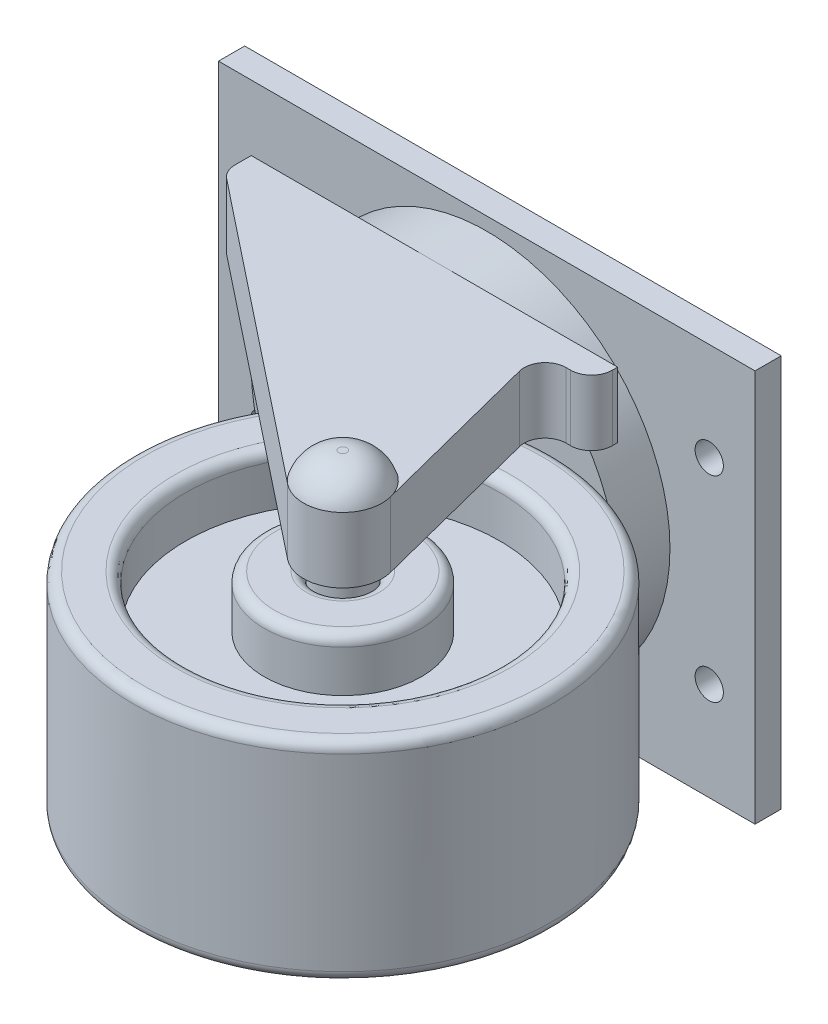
ISO-10303-21;
HEADER;
FILE_DESCRIPTION(('STEP AP214'),'2;1');
FILE_NAME('part.step','',(''),(''),'','','');
FILE_SCHEMA(('AUTOMOTIVE_DESIGN { 1 0 10303 214 1 1 1 1 }'));
ENDSEC;
DATA;
#1=APPLICATION_CONTEXT('core data for automotive mechanical design processes');
#2=APPLICATION_PROTOCOL_DEFINITION('international standard','automotive_design',2000,#1);
#3=PRODUCT_CONTEXT('',#1,'mechanical');
#4=PRODUCT('Part','Part','',(#3));
#5=PRODUCT_RELATED_PRODUCT_CATEGORY('part','',(#4));
#6=PRODUCT_DEFINITION_FORMATION('','',#4);
#7=PRODUCT_DEFINITION_CONTEXT('part definition',#1,'design');
#8=PRODUCT_DEFINITION('design','',#6,#7);
#9=PRODUCT_DEFINITION_SHAPE('','',#8);
#10=(LENGTH_UNIT() NAMED_UNIT(*) SI_UNIT(.MILLI.,.METRE.));
#11=(NAMED_UNIT(*) PLANE_ANGLE_UNIT() SI_UNIT($,.RADIAN.));
#12=(NAMED_UNIT(*) SI_UNIT($,.STERADIAN.) SOLID_ANGLE_UNIT());
#13=UNCERTAINTY_MEASURE_WITH_UNIT(LENGTH_MEASURE(1.E-05),#10,'distance_accuracy_value','');
#14=(GEOMETRIC_REPRESENTATION_CONTEXT(3) GLOBAL_UNCERTAINTY_ASSIGNED_CONTEXT((#13)) GLOBAL_UNIT_ASSIGNED_CONTEXT((#10,
#11,#12)) REPRESENTATION_CONTEXT('',''));
#15=CARTESIAN_POINT('',(0.,0.,0.));
#16=DIRECTION('',(0.,0.,1.));
#17=DIRECTION('',(1.,0.,0.));
#18=AXIS2_PLACEMENT_3D('',#15,#16,#17);
#19=CARTESIAN_POINT('',(-283.235148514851,2.49389438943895,-11.90625));
#20=DIRECTION('',(0.,0.,1.));
#21=DIRECTION('',(1.,0.,0.));
#22=AXIS2_PLACEMENT_3D('',#19,#20,#21);
#23=PLANE('',#22);
#24=CARTESIAN_POINT('',(-283.235148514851,2.49389438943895,-11.90625));
#25=DIRECTION('',(0.,0.,1.));
#26=DIRECTION('',(1.,0.,0.));
#27=AXIS2_PLACEMENT_3D('',#24,#25,#26);
#28=CIRCLE('',#27,22.225);
#29=CARTESIAN_POINT('',(-300.259189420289,16.7813943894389,-11.90625));
#30=VERTEX_POINT('',#29);
#31=CARTESIAN_POINT('',(-300.259189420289,-11.793605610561,-11.90625));
#32=VERTEX_POINT('',#31);
#33=EDGE_CURVE('P0_E884',#30,#32,#28,.T.);
#34=ORIENTED_EDGE('',*,*,#33,.T.);
#35=DIRECTION('',(1.,0.,0.));
#36=VECTOR('',#35,1.);
#37=CARTESIAN_POINT('',(-283.235148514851,-11.793605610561,-11.90625));
#38=LINE('',#37,#36);
#39=CARTESIAN_POINT('',(-266.211107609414,-11.7936056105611,-11.90625));
#40=VERTEX_POINT('',#39);
#41=EDGE_CURVE('P0_E376',#32,#40,#38,.T.);
#42=ORIENTED_EDGE('',*,*,#41,.T.);
#43=CARTESIAN_POINT('',(-266.211107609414,16.7813943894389,-11.90625));
#44=VERTEX_POINT('',#43);
#45=EDGE_CURVE('P0_E314',#40,#44,#28,.T.);
#46=ORIENTED_EDGE('',*,*,#45,.T.);
#47=DIRECTION('',(1.,0.,0.));
#48=VECTOR('',#47,1.);
#49=CARTESIAN_POINT('',(-261.010148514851,16.7813943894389,-11.90625));
#50=LINE('',#49,#48);
#51=EDGE_CURVE('P0_E299',#30,#44,#50,.T.);
#52=ORIENTED_EDGE('',*,*,#51,.F.);
#53=EDGE_LOOP('',(#34,#42,#46,#52));
#54=FACE_BOUND('',#53,.T.);
#55=ADVANCED_FACE('P0_F29',(#54),#23,.T.);
#56=CARTESIAN_POINT('',(-315.778898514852,26.3063943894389,-18.25625));
#57=DIRECTION('',(0.,0.,-1.));
#58=DIRECTION('',(-1.,0.,0.));
#59=AXIS2_PLACEMENT_3D('',#56,#57,#58);
#60=PLANE('',#59);
#61=DIRECTION('',(0.,-1.,0.));
#62=VECTOR('',#61,1.);
#63=CARTESIAN_POINT('',(-315.778898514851,-21.3186056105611,-18.25625));
#64=LINE('',#63,#62);
#65=CARTESIAN_POINT('',(-315.778898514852,26.3063943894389,-18.25625));
#66=VERTEX_POINT('',#65);
#67=CARTESIAN_POINT('',(-315.778898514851,-21.3186056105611,-18.25625));
#68=VERTEX_POINT('',#67);
#69=EDGE_CURVE('P0_E352',#66,#68,#64,.T.);
#70=ORIENTED_EDGE('',*,*,#69,.T.);
#71=DIRECTION('',(1.,0.,0.));
#72=VECTOR('',#71,1.);
#73=CARTESIAN_POINT('',(-315.778898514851,-21.3186056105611,-18.25625));
#74=LINE('',#73,#72);
#75=CARTESIAN_POINT('',(-250.691398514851,-21.3186056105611,-18.25625));
#76=VERTEX_POINT('',#75);
#77=EDGE_CURVE('P0_E355',#68,#76,#74,.T.);
#78=ORIENTED_EDGE('',*,*,#77,.T.);
#79=DIRECTION('',(0.,1.,0.));
#80=VECTOR('',#79,1.);
#81=CARTESIAN_POINT('',(-250.691398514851,-21.3186056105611,-18.25625));
#82=LINE('',#81,#80);
#83=CARTESIAN_POINT('',(-250.691398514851,26.3063943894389,-18.25625));
#84=VERTEX_POINT('',#83);
#85=EDGE_CURVE('P0_E357',#76,#84,#82,.T.);
#86=ORIENTED_EDGE('',*,*,#85,.T.);
#87=DIRECTION('',(-1.,0.,0.));
#88=VECTOR('',#87,1.);
#89=CARTESIAN_POINT('',(-315.778898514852,26.3063943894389,-18.25625));
#90=LINE('',#89,#88);
#91=EDGE_CURVE('P0_E359',#84,#66,#90,.T.);
#92=ORIENTED_EDGE('',*,*,#91,.T.);
#93=EDGE_LOOP('',(#70,#78,#86,#92));
#94=FACE_BOUND('',#93,.T.);
#95=CARTESIAN_POINT('',(-256.247648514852,14.400144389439,-18.25625));
#96=DIRECTION('',(0.,0.,1.));
#97=DIRECTION('',(1.,0.,0.));
#98=AXIS2_PLACEMENT_3D('',#95,#96,#97);
#99=CIRCLE('',#98,1.71469454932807);
#100=CARTESIAN_POINT('',(-254.532953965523,14.400144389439,-18.25625));
#101=VERTEX_POINT('',#100);
#102=EDGE_CURVE('P0_E337',#101,#101,#99,.T.);
#103=ORIENTED_EDGE('',*,*,#102,.F.);
#104=EDGE_LOOP('',(#103));
#105=FACE_BOUND('',#104,.T.);
#106=CARTESIAN_POINT('',(-256.247648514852,-9.41235561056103,-18.25625));
#107=DIRECTION('',(0.,0.,1.));
#108=DIRECTION('',(1.,0.,0.));
#109=AXIS2_PLACEMENT_3D('',#106,#107,#108);
#110=CIRCLE('',#109,1.71469454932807);
#111=CARTESIAN_POINT('',(-254.532953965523,-9.41235561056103,-18.25625));
#112=VERTEX_POINT('',#111);
#113=EDGE_CURVE('P0_E331',#112,#112,#110,.T.);
#114=ORIENTED_EDGE('',*,*,#113,.F.);
#115=EDGE_LOOP('',(#114));
#116=FACE_BOUND('',#115,.T.);
#117=CARTESIAN_POINT('',(-310.222648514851,-9.41235561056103,-18.25625));
#118=DIRECTION('',(0.,0.,1.));
#119=DIRECTION('',(1.,0.,0.));
#120=AXIS2_PLACEMENT_3D('',#117,#118,#119);
#121=CIRCLE('',#120,1.71469454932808);
#122=CARTESIAN_POINT('',(-308.507953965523,-9.41235561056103,-18.25625));
#123=VERTEX_POINT('',#122);
#124=EDGE_CURVE('P0_E325',#123,#123,#121,.T.);
#125=ORIENTED_EDGE('',*,*,#124,.F.);
#126=EDGE_LOOP('',(#125));
#127=FACE_BOUND('',#126,.T.);
#128=CARTESIAN_POINT('',(-310.222648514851,14.400144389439,-18.25625));
#129=DIRECTION('',(0.,0.,1.));
#130=DIRECTION('',(1.,0.,0.));
#131=AXIS2_PLACEMENT_3D('',#128,#129,#130);
#132=CIRCLE('',#131,1.71469454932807);
#133=CARTESIAN_POINT('',(-308.507953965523,14.400144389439,-18.25625));
#134=VERTEX_POINT('',#133);
#135=EDGE_CURVE('P0_E318',#134,#134,#132,.T.);
#136=ORIENTED_EDGE('',*,*,#135,.F.);
#137=EDGE_LOOP('',(#136));
#138=FACE_BOUND('',#137,.T.);
#139=CARTESIAN_POINT('',(-283.235148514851,2.49389438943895,-18.25625));
#140=DIRECTION('',(0.,0.,-1.));
#141=DIRECTION('',(-1.,0.,0.));
#142=AXIS2_PLACEMENT_3D('',#139,#140,#141);
#143=CIRCLE('',#142,22.225);
#144=CARTESIAN_POINT('',(-305.460148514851,2.49389438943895,-18.25625));
#145=VERTEX_POINT('',#144);
#146=EDGE_CURVE('P0_E373',#145,#145,#143,.F.);
#147=ORIENTED_EDGE('',*,*,#146,.F.);
#148=EDGE_LOOP('',(#147));
#149=FACE_BOUND('',#148,.T.);
#150=ADVANCED_FACE('P0_F451',(#94,#105,#116,#127,#138,#149),#60,.F.);
#151=CARTESIAN_POINT('',(-315.778898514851,-21.3186056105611,-18.25625));
#152=DIRECTION('',(1.,0.,0.));
#153=DIRECTION('',(0.,1.,0.));
#154=AXIS2_PLACEMENT_3D('',#151,#152,#153);
#155=PLANE('',#154);
#156=DIRECTION('',(0.,-1.,0.));
#157=VECTOR('',#156,1.);
#158=CARTESIAN_POINT('',(-315.778898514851,-21.3186056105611,-21.43125));
#159=LINE('',#158,#157);
#160=CARTESIAN_POINT('',(-315.778898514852,26.3063943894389,-21.43125));
#161=VERTEX_POINT('',#160);
#162=CARTESIAN_POINT('',(-315.778898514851,-21.3186056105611,-21.43125));
#163=VERTEX_POINT('',#162);
#164=EDGE_CURVE('P0_E343',#161,#163,#159,.T.);
#165=ORIENTED_EDGE('',*,*,#164,.T.);
#166=DIRECTION('',(0.,0.,-1.));
#167=VECTOR('',#166,1.);
#168=CARTESIAN_POINT('',(-315.778898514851,-21.3186056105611,-18.25625));
#169=LINE('',#168,#167);
#170=EDGE_CURVE('P0_E370',#68,#163,#169,.T.);
#171=ORIENTED_EDGE('',*,*,#170,.F.);
#172=ORIENTED_EDGE('',*,*,#69,.F.);
#173=DIRECTION('',(0.,0.,-1.));
#174=VECTOR('',#173,1.);
#175=CARTESIAN_POINT('',(-315.778898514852,26.3063943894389,-18.25625));
#176=LINE('',#175,#174);
#177=EDGE_CURVE('P0_E361',#66,#161,#176,.T.);
#178=ORIENTED_EDGE('',*,*,#177,.T.);
#179=EDGE_LOOP('',(#165,#171,#172,#178));
#180=FACE_BOUND('',#179,.T.);
#181=ADVANCED_FACE('P0_F31',(#180),#155,.F.);
#182=CARTESIAN_POINT('',(-315.778898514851,-21.3186056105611,-18.25625));
#183=DIRECTION('',(0.,1.,0.));
#184=DIRECTION('',(0.,0.,1.));
#185=AXIS2_PLACEMENT_3D('',#182,#183,#184);
#186=PLANE('',#185);
#187=DIRECTION('',(1.,0.,0.));
#188=VECTOR('',#187,1.);
#189=CARTESIAN_POINT('',(-315.778898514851,-21.3186056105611,-21.43125));
#190=LINE('',#189,#188);
#191=CARTESIAN_POINT('',(-250.691398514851,-21.3186056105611,-21.43125));
#192=VERTEX_POINT('',#191);
#193=EDGE_CURVE('P0_E346',#163,#192,#190,.T.);
#194=ORIENTED_EDGE('',*,*,#193,.T.);
#195=DIRECTION('',(0.,0.,-1.));
#196=VECTOR('',#195,1.);
#197=CARTESIAN_POINT('',(-250.691398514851,-21.3186056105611,-18.25625));
#198=LINE('',#197,#196);
#199=EDGE_CURVE('P0_E367',#76,#192,#198,.T.);
#200=ORIENTED_EDGE('',*,*,#199,.F.);
#201=ORIENTED_EDGE('',*,*,#77,.F.);
#202=ORIENTED_EDGE('',*,*,#170,.T.);
#203=EDGE_LOOP('',(#194,#200,#201,#202));
#204=FACE_BOUND('',#203,.T.);
#205=ADVANCED_FACE('P0_F495',(#204),#186,.F.);
#206=CARTESIAN_POINT('',(-250.691398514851,-21.3186056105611,-18.25625));
#207=DIRECTION('',(-1.,0.,0.));
#208=DIRECTION('',(0.,-1.,0.));
#209=AXIS2_PLACEMENT_3D('',#206,#207,#208);
#210=PLANE('',#209);
#211=DIRECTION('',(0.,1.,0.));
#212=VECTOR('',#211,1.);
#213=CARTESIAN_POINT('',(-250.691398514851,-21.3186056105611,-21.43125));
#214=LINE('',#213,#212);
#215=CARTESIAN_POINT('',(-250.691398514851,26.3063943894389,-21.43125));
#216=VERTEX_POINT('',#215);
#217=EDGE_CURVE('P0_E348',#192,#216,#214,.T.);
#218=ORIENTED_EDGE('',*,*,#217,.T.);
#219=DIRECTION('',(0.,0.,-1.));
#220=VECTOR('',#219,1.);
#221=CARTESIAN_POINT('',(-250.691398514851,26.3063943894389,-18.25625));
#222=LINE('',#221,#220);
#223=EDGE_CURVE('P0_E364',#84,#216,#222,.T.);
#224=ORIENTED_EDGE('',*,*,#223,.F.);
#225=ORIENTED_EDGE('',*,*,#85,.F.);
#226=ORIENTED_EDGE('',*,*,#199,.T.);
#227=EDGE_LOOP('',(#218,#224,#225,#226));
#228=FACE_BOUND('',#227,.T.);
#229=ADVANCED_FACE('P0_F492',(#228),#210,.F.);
#230=CARTESIAN_POINT('',(-315.778898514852,26.3063943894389,-18.25625));
#231=DIRECTION('',(0.,-1.,0.));
#232=DIRECTION('',(0.,0.,-1.));
#233=AXIS2_PLACEMENT_3D('',#230,#231,#232);
#234=PLANE('',#233);
#235=DIRECTION('',(-1.,0.,0.));
#236=VECTOR('',#235,1.);
#237=CARTESIAN_POINT('',(-315.778898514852,26.3063943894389,-21.43125));
#238=LINE('',#237,#236);
#239=EDGE_CURVE('P0_E350',#216,#161,#238,.T.);
#240=ORIENTED_EDGE('',*,*,#239,.T.);
#241=ORIENTED_EDGE('',*,*,#177,.F.);
#242=ORIENTED_EDGE('',*,*,#91,.F.);
#243=ORIENTED_EDGE('',*,*,#223,.T.);
#244=EDGE_LOOP('',(#240,#241,#242,#243));
#245=FACE_BOUND('',#244,.T.);
#246=ADVANCED_FACE('P0_F487',(#245),#234,.F.);
#247=CARTESIAN_POINT('',(-315.778898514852,26.3063943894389,-21.43125));
#248=DIRECTION('',(0.,0.,-1.));
#249=DIRECTION('',(-1.,0.,0.));
#250=AXIS2_PLACEMENT_3D('',#247,#248,#249);
#251=PLANE('',#250);
#252=CARTESIAN_POINT('',(-310.222648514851,14.400144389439,-21.43125));
#253=DIRECTION('',(0.,0.,1.));
#254=DIRECTION('',(1.,0.,0.));
#255=AXIS2_PLACEMENT_3D('',#252,#253,#254);
#256=CIRCLE('',#255,1.71469454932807);
#257=CARTESIAN_POINT('',(-308.507953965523,14.400144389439,-21.43125));
#258=VERTEX_POINT('',#257);
#259=EDGE_CURVE('P0_E322',#258,#258,#256,.T.);
#260=ORIENTED_EDGE('',*,*,#259,.T.);
#261=EDGE_LOOP('',(#260));
#262=FACE_BOUND('',#261,.T.);
#263=CARTESIAN_POINT('',(-310.222648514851,-9.41235561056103,-21.43125));
#264=DIRECTION('',(0.,0.,1.));
#265=DIRECTION('',(1.,0.,0.));
#266=AXIS2_PLACEMENT_3D('',#263,#264,#265);
#267=CIRCLE('',#266,1.71469454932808);
#268=CARTESIAN_POINT('',(-308.507953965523,-9.41235561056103,-21.43125));
#269=VERTEX_POINT('',#268);
#270=EDGE_CURVE('P0_E328',#269,#269,#267,.T.);
#271=ORIENTED_EDGE('',*,*,#270,.T.);
#272=EDGE_LOOP('',(#271));
#273=FACE_BOUND('',#272,.T.);
#274=CARTESIAN_POINT('',(-256.247648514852,-9.41235561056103,-21.43125));
#275=DIRECTION('',(0.,0.,1.));
#276=DIRECTION('',(1.,0.,0.));
#277=AXIS2_PLACEMENT_3D('',#274,#275,#276);
#278=CIRCLE('',#277,1.71469454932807);
#279=CARTESIAN_POINT('',(-254.532953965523,-9.41235561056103,-21.43125));
#280=VERTEX_POINT('',#279);
#281=EDGE_CURVE('P0_E334',#280,#280,#278,.T.);
#282=ORIENTED_EDGE('',*,*,#281,.T.);
#283=EDGE_LOOP('',(#282));
#284=FACE_BOUND('',#283,.T.);
#285=CARTESIAN_POINT('',(-256.247648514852,14.400144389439,-21.43125));
#286=DIRECTION('',(0.,0.,1.));
#287=DIRECTION('',(1.,0.,0.));
#288=AXIS2_PLACEMENT_3D('',#285,#286,#287);
#289=CIRCLE('',#288,1.71469454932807);
#290=CARTESIAN_POINT('',(-254.532953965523,14.400144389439,-21.43125));
#291=VERTEX_POINT('',#290);
#292=EDGE_CURVE('P0_E340',#291,#291,#289,.T.);
#293=ORIENTED_EDGE('',*,*,#292,.T.);
#294=EDGE_LOOP('',(#293));
#295=FACE_BOUND('',#294,.T.);
#296=ORIENTED_EDGE('',*,*,#164,.F.);
#297=ORIENTED_EDGE('',*,*,#239,.F.);
#298=ORIENTED_EDGE('',*,*,#217,.F.);
#299=ORIENTED_EDGE('',*,*,#193,.F.);
#300=EDGE_LOOP('',(#296,#297,#298,#299));
#301=FACE_BOUND('',#300,.T.);
#302=ADVANCED_FACE('P0_F484',(#262,#273,#284,#295,#301),#251,.T.);
#303=CARTESIAN_POINT('',(-256.247648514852,14.400144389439,-21.43125));
#304=DIRECTION('',(0.,0.,1.));
#305=DIRECTION('',(1.,0.,0.));
#306=AXIS2_PLACEMENT_3D('',#303,#304,#305);
#307=CYLINDRICAL_SURFACE('',#306,1.71469454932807);
#308=ORIENTED_EDGE('',*,*,#292,.F.);
#309=EDGE_LOOP('',(#308));
#310=FACE_BOUND('',#309,.T.);
#311=ORIENTED_EDGE('',*,*,#102,.T.);
#312=EDGE_LOOP('',(#311));
#313=FACE_BOUND('',#312,.T.);
#314=ADVANCED_FACE('P0_F480',(#310,#313),#307,.F.);
#315=CARTESIAN_POINT('',(-256.247648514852,-9.41235561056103,-21.43125));
#316=DIRECTION('',(0.,0.,1.));
#317=DIRECTION('',(1.,0.,0.));
#318=AXIS2_PLACEMENT_3D('',#315,#316,#317);
#319=CYLINDRICAL_SURFACE('',#318,1.71469454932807);
#320=ORIENTED_EDGE('',*,*,#281,.F.);
#321=EDGE_LOOP('',(#320));
#322=FACE_BOUND('',#321,.T.);
#323=ORIENTED_EDGE('',*,*,#113,.T.);
#324=EDGE_LOOP('',(#323));
#325=FACE_BOUND('',#324,.T.);
#326=ADVANCED_FACE('P0_F476',(#322,#325),#319,.F.);
#327=CARTESIAN_POINT('',(-310.222648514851,-9.41235561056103,-21.43125));
#328=DIRECTION('',(0.,0.,1.));
#329=DIRECTION('',(1.,0.,0.));
#330=AXIS2_PLACEMENT_3D('',#327,#328,#329);
#331=CYLINDRICAL_SURFACE('',#330,1.71469454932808);
#332=ORIENTED_EDGE('',*,*,#270,.F.);
#333=EDGE_LOOP('',(#332));
#334=FACE_BOUND('',#333,.T.);
#335=ORIENTED_EDGE('',*,*,#124,.T.);
#336=EDGE_LOOP('',(#335));
#337=FACE_BOUND('',#336,.T.);
#338=ADVANCED_FACE('P0_F472',(#334,#337),#331,.F.);
#339=CARTESIAN_POINT('',(-310.222648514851,14.400144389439,-21.43125));
#340=DIRECTION('',(0.,0.,1.));
#341=DIRECTION('',(1.,0.,0.));
#342=AXIS2_PLACEMENT_3D('',#339,#340,#341);
#343=CYLINDRICAL_SURFACE('',#342,1.71469454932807);
#344=ORIENTED_EDGE('',*,*,#259,.F.);
#345=EDGE_LOOP('',(#344));
#346=FACE_BOUND('',#345,.T.);
#347=ORIENTED_EDGE('',*,*,#135,.T.);
#348=EDGE_LOOP('',(#347));
#349=FACE_BOUND('',#348,.T.);
#350=ADVANCED_FACE('P0_F468',(#346,#349),#343,.F.);
#351=CARTESIAN_POINT('',(-283.235148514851,2.49389438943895,-11.90625));
#352=DIRECTION('',(0.,0.,-1.));
#353=DIRECTION('',(-1.,0.,0.));
#354=AXIS2_PLACEMENT_3D('',#351,#352,#353);
#355=CYLINDRICAL_SURFACE('',#354,22.225);
#356=CARTESIAN_POINT('',(-283.235148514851,24.7188943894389,-11.90625));
#357=VERTEX_POINT('',#356);
#358=EDGE_CURVE('P0_E315',#44,#357,#28,.T.);
#359=ORIENTED_EDGE('',*,*,#358,.F.);
#360=ORIENTED_EDGE('',*,*,#45,.F.);
#361=CARTESIAN_POINT('',(-283.235148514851,-19.7311056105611,-11.90625));
#362=VERTEX_POINT('',#361);
#363=EDGE_CURVE('P0_E880',#362,#40,#28,.T.);
#364=ORIENTED_EDGE('',*,*,#363,.F.);
#365=EDGE_CURVE('P0_E872',#32,#362,#28,.T.);
#366=ORIENTED_EDGE('',*,*,#365,.F.);
#367=ORIENTED_EDGE('',*,*,#33,.F.);
#368=EDGE_CURVE('P0_E319',#357,#30,#28,.T.);
#369=ORIENTED_EDGE('',*,*,#368,.F.);
#370=EDGE_LOOP('',(#359,#360,#364,#366,#367,#369));
#371=FACE_BOUND('',#370,.T.);
#372=ORIENTED_EDGE('',*,*,#146,.T.);
#373=EDGE_LOOP('',(#372));
#374=FACE_BOUND('',#373,.T.);
#375=ADVANCED_FACE('P0_F464',(#371,#374),#355,.T.);
#376=CARTESIAN_POINT('',(-305.460148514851,24.7188943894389,-11.90625));
#377=DIRECTION('',(0.,0.,1.));
#378=DIRECTION('',(1.,0.,0.));
#379=AXIS2_PLACEMENT_3D('',#376,#377,#378);
#380=PLANE('',#379);
#381=CARTESIAN_POINT('',(-261.010148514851,16.7813943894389,-11.90625));
#382=VERTEX_POINT('',#381);
#383=EDGE_CURVE('P0_E294',#44,#382,#50,.T.);
#384=ORIENTED_EDGE('',*,*,#383,.F.);
#385=ORIENTED_EDGE('',*,*,#358,.T.);
#386=DIRECTION('',(-1.,0.,0.));
#387=VECTOR('',#386,1.);
#388=CARTESIAN_POINT('',(-305.460148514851,24.7188943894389,-11.90625));
#389=LINE('',#388,#387);
#390=CARTESIAN_POINT('',(-261.010148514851,24.7188943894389,-11.90625));
#391=VERTEX_POINT('',#390);
#392=EDGE_CURVE('P0_E303',#391,#357,#389,.T.);
#393=ORIENTED_EDGE('',*,*,#392,.F.);
#394=DIRECTION('',(0.,1.,0.));
#395=VECTOR('',#394,1.);
#396=CARTESIAN_POINT('',(-261.010148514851,24.7188943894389,-11.90625));
#397=LINE('',#396,#395);
#398=EDGE_CURVE('P0_E298',#382,#391,#397,.T.);
#399=ORIENTED_EDGE('',*,*,#398,.F.);
#400=EDGE_LOOP('',(#384,#385,#393,#399));
#401=FACE_BOUND('',#400,.T.);
#402=ADVANCED_FACE('P0_F467',(#401),#380,.F.);
#403=CARTESIAN_POINT('',(-305.460148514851,24.7188943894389,-11.90625));
#404=VERTEX_POINT('',#403);
#405=EDGE_CURVE('P0_E302',#357,#404,#389,.T.);
#406=ORIENTED_EDGE('',*,*,#405,.F.);
#407=ORIENTED_EDGE('',*,*,#368,.T.);
#408=CARTESIAN_POINT('',(-305.460148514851,16.7813943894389,-11.90625));
#409=VERTEX_POINT('',#408);
#410=EDGE_CURVE('P0_E295',#409,#30,#50,.T.);
#411=ORIENTED_EDGE('',*,*,#410,.F.);
#412=DIRECTION('',(0.,-1.,0.));
#413=VECTOR('',#412,1.);
#414=CARTESIAN_POINT('',(-305.460148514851,24.7188943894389,-11.90625));
#415=LINE('',#414,#413);
#416=EDGE_CURVE('P0_E291',#404,#409,#415,.T.);
#417=ORIENTED_EDGE('',*,*,#416,.F.);
#418=EDGE_LOOP('',(#406,#407,#411,#417));
#419=FACE_BOUND('',#418,.T.);
#420=ADVANCED_FACE('P0_F602',(#419),#380,.F.);
#421=CARTESIAN_POINT('',(-305.460148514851,24.7188943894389,23.01875));
#422=DIRECTION('',(1.,0.,0.));
#423=DIRECTION('',(0.,0.,-1.));
#424=AXIS2_PLACEMENT_3D('',#421,#422,#423);
#425=PLANE('',#424);
#426=DIRECTION('',(0.,0.,-1.));
#427=VECTOR('',#426,1.);
#428=CARTESIAN_POINT('',(-305.460148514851,16.7813943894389,23.01875));
#429=LINE('',#428,#427);
#430=CARTESIAN_POINT('',(-305.460148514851,16.7813943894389,-9.95858218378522));
#431=VERTEX_POINT('',#430);
#432=EDGE_CURVE('P0_E312',#431,#409,#429,.T.);
#433=ORIENTED_EDGE('',*,*,#432,.F.);
#434=DIRECTION('',(0.,1.,0.));
#435=VECTOR('',#434,1.);
#436=CARTESIAN_POINT('',(-305.460148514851,24.7188943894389,-9.95858218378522));
#437=LINE('',#436,#435);
#438=CARTESIAN_POINT('',(-305.460148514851,24.7188943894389,-9.95858218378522));
#439=VERTEX_POINT('',#438);
#440=EDGE_CURVE('P0_E402',#431,#439,#437,.T.);
#441=ORIENTED_EDGE('',*,*,#440,.T.);
#442=DIRECTION('',(0.,0.,-1.));
#443=VECTOR('',#442,1.);
#444=CARTESIAN_POINT('',(-305.460148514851,24.7188943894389,23.01875));
#445=LINE('',#444,#443);
#446=EDGE_CURVE('P0_E306',#439,#404,#445,.T.);
#447=ORIENTED_EDGE('',*,*,#446,.T.);
#448=ORIENTED_EDGE('',*,*,#416,.T.);
#449=EDGE_LOOP('',(#433,#441,#447,#448));
#450=FACE_BOUND('',#449,.T.);
#451=ADVANCED_FACE('P0_F462',(#450),#425,.F.);
#452=CARTESIAN_POINT('',(-261.010148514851,16.7813943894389,23.01875));
#453=DIRECTION('',(0.,1.,0.));
#454=DIRECTION('',(-1.,0.,0.));
#455=AXIS2_PLACEMENT_3D('',#452,#453,#454);
#456=PLANE('',#455);
#457=CARTESIAN_POINT('',(-265.772648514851,16.7813943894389,16.66875));
#458=DIRECTION('',(0.,1.,0.));
#459=DIRECTION('',(-1.,0.,0.));
#460=AXIS2_PLACEMENT_3D('',#457,#458,#459);
#461=CIRCLE('',#460,3.175);
#462=CARTESIAN_POINT('',(-268.947648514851,16.7813943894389,16.66875));
#463=VERTEX_POINT('',#462);
#464=EDGE_CURVE('P0_E267',#463,#463,#461,.T.);
#465=ORIENTED_EDGE('',*,*,#464,.T.);
#466=EDGE_LOOP('',(#465));
#467=FACE_BOUND('',#466,.T.);
#468=DIRECTION('',(-0.783474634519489,0.,-0.621423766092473));
#469=VECTOR('',#468,1.);
#470=CARTESIAN_POINT('',(-262.717178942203,16.7813943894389,25.1709287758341));
#471=LINE('',#470,#469);
#472=CARTESIAN_POINT('',(-268.732179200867,16.7813943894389,20.4000479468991));
#473=VERTEX_POINT('',#472);
#474=CARTESIAN_POINT('',(-304.498564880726,16.7813943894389,-7.96855661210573));
#475=VERTEX_POINT('',#474);
#476=EDGE_CURVE('P0_E245',#473,#475,#471,.T.);
#477=ORIENTED_EDGE('',*,*,#476,.T.);
#478=CARTESIAN_POINT('',(-302.920148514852,16.7813943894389,-9.95858218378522));
#479=DIRECTION('',(0.,1.,0.));
#480=DIRECTION('',(-1.,0.,0.));
#481=AXIS2_PLACEMENT_3D('',#478,#479,#480);
#482=CIRCLE('',#481,2.54);
#483=EDGE_CURVE('P0_E413',#475,#431,#482,.F.);
#484=ORIENTED_EDGE('',*,*,#483,.T.);
#485=ORIENTED_EDGE('',*,*,#432,.T.);
#486=ORIENTED_EDGE('',*,*,#410,.T.);
#487=ORIENTED_EDGE('',*,*,#51,.T.);
#488=ORIENTED_EDGE('',*,*,#383,.T.);
#489=DIRECTION('',(0.,0.,-1.));
#490=VECTOR('',#489,1.);
#491=CARTESIAN_POINT('',(-261.010148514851,16.7813943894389,23.01875));
#492=LINE('',#491,#490);
#493=CARTESIAN_POINT('',(-261.010148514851,16.7813943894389,-11.27125));
#494=VERTEX_POINT('',#493);
#495=EDGE_CURVE('P0_E310',#494,#382,#492,.T.);
#496=ORIENTED_EDGE('',*,*,#495,.F.);
#497=CARTESIAN_POINT('',(-263.550148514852,16.7813943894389,-11.27125));
#498=DIRECTION('',(0.,1.,0.));
#499=DIRECTION('',(-1.,0.,0.));
#500=AXIS2_PLACEMENT_3D('',#497,#498,#499);
#501=CIRCLE('',#500,2.54);
#502=CARTESIAN_POINT('',(-263.550148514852,16.7813943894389,-8.73125000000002));
#503=VERTEX_POINT('',#502);
#504=EDGE_CURVE('P0_E411',#494,#503,#501,.F.);
#505=ORIENTED_EDGE('',*,*,#504,.T.);
#506=DIRECTION('',(-1.,0.,0.));
#507=VECTOR('',#506,1.);
#508=CARTESIAN_POINT('',(-261.010148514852,16.7813943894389,-8.73125000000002));
#509=LINE('',#508,#507);
#510=CARTESIAN_POINT('',(-264.087843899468,16.7813943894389,-8.73125000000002));
#511=VERTEX_POINT('',#510);
#512=EDGE_CURVE('P0_E251',#503,#511,#509,.T.);
#513=ORIENTED_EDGE('',*,*,#512,.T.);
#514=CARTESIAN_POINT('',(-264.087843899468,16.7813943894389,-6.19125000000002));
#515=DIRECTION('',(0.,1.,0.));
#516=DIRECTION('',(-1.,0.,0.));
#517=AXIS2_PLACEMENT_3D('',#514,#515,#516);
#518=CIRCLE('',#517,2.54);
#519=CARTESIAN_POINT('',(-266.548463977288,16.7813943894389,-5.56121124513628));
#520=VERTEX_POINT('',#519);
#521=EDGE_CURVE('P0_E11',#511,#520,#518,.T.);
#522=ORIENTED_EDGE('',*,*,#521,.T.);
#523=DIRECTION('',(0.248046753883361,0.,0.968748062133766));
#524=VECTOR('',#523,1.);
#525=CARTESIAN_POINT('',(-259.340090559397,16.7813943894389,22.5911337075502));
#526=LINE('',#525,#524);
#527=CARTESIAN_POINT('',(-261.158985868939,16.7813943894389,15.4874273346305));
#528=VERTEX_POINT('',#527);
#529=EDGE_CURVE('P0_E255',#520,#528,#526,.T.);
#530=ORIENTED_EDGE('',*,*,#529,.T.);
#531=CARTESIAN_POINT('',(-265.772648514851,16.7813943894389,16.66875));
#532=DIRECTION('',(0.,1.,0.));
#533=DIRECTION('',(-1.,0.,0.));
#534=AXIS2_PLACEMENT_3D('',#531,#532,#533);
#535=CIRCLE('',#534,4.7625);
#536=EDGE_CURVE('P0_E226',#528,#473,#535,.F.);
#537=ORIENTED_EDGE('',*,*,#536,.T.);
#538=EDGE_LOOP('',(#477,#484,#485,#486,#487,#488,#496,#505,#513,#522,#530,#537));
#539=FACE_BOUND('',#538,.T.);
#540=ADVANCED_FACE('P0_F618',(#467,#539),#456,.F.);
#541=CARTESIAN_POINT('',(-261.010148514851,24.7188943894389,23.01875));
#542=DIRECTION('',(-1.,0.,0.));
#543=DIRECTION('',(0.,0.,1.));
#544=AXIS2_PLACEMENT_3D('',#541,#542,#543);
#545=PLANE('',#544);
#546=DIRECTION('',(0.,0.,-1.));
#547=VECTOR('',#546,1.);
#548=CARTESIAN_POINT('',(-261.010148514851,24.7188943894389,23.01875));
#549=LINE('',#548,#547);
#550=CARTESIAN_POINT('',(-261.010148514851,24.7188943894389,-11.27125));
#551=VERTEX_POINT('',#550);
#552=EDGE_CURVE('P0_E308',#551,#391,#549,.T.);
#553=ORIENTED_EDGE('',*,*,#552,.F.);
#554=DIRECTION('',(0.,-1.,0.));
#555=VECTOR('',#554,1.);
#556=CARTESIAN_POINT('',(-261.010148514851,24.7188943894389,-11.27125));
#557=LINE('',#556,#555);
#558=EDGE_CURVE('P0_E425',#551,#494,#557,.T.);
#559=ORIENTED_EDGE('',*,*,#558,.T.);
#560=ORIENTED_EDGE('',*,*,#495,.T.);
#561=ORIENTED_EDGE('',*,*,#398,.T.);
#562=EDGE_LOOP('',(#553,#559,#560,#561));
#563=FACE_BOUND('',#562,.T.);
#564=ADVANCED_FACE('P0_F626',(#563),#545,.F.);
#565=CARTESIAN_POINT('',(-305.460148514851,24.7188943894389,23.01875));
#566=DIRECTION('',(0.,-1.,0.));
#567=DIRECTION('',(0.,0.,-1.));
#568=AXIS2_PLACEMENT_3D('',#565,#566,#567);
#569=PLANE('',#568);
#570=CARTESIAN_POINT('',(-265.772648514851,24.7188943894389,16.66875));
#571=DIRECTION('',(0.,1.,0.));
#572=DIRECTION('',(0.,0.,1.));
#573=AXIS2_PLACEMENT_3D('',#570,#571,#572);
#574=CIRCLE('',#573,3.175);
#575=CARTESIAN_POINT('',(-265.772648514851,24.7188943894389,19.84375));
#576=VERTEX_POINT('',#575);
#577=EDGE_CURVE('P0_E260',#576,#576,#574,.T.);
#578=ORIENTED_EDGE('',*,*,#577,.F.);
#579=EDGE_LOOP('',(#578));
#580=FACE_BOUND('',#579,.T.);
#581=ORIENTED_EDGE('',*,*,#446,.F.);
#582=CARTESIAN_POINT('',(-302.920148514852,24.7188943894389,-9.95858218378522));
#583=DIRECTION('',(0.,-1.,0.));
#584=DIRECTION('',(0.,0.,-1.));
#585=AXIS2_PLACEMENT_3D('',#582,#583,#584);
#586=CIRCLE('',#585,2.54);
#587=CARTESIAN_POINT('',(-304.498564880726,24.7188943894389,-7.96855661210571));
#588=VERTEX_POINT('',#587);
#589=EDGE_CURVE('P0_E407',#439,#588,#586,.F.);
#590=ORIENTED_EDGE('',*,*,#589,.T.);
#591=DIRECTION('',(-0.783474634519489,0.,-0.621423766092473));
#592=VECTOR('',#591,1.);
#593=CARTESIAN_POINT('',(-268.732179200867,24.7188943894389,20.4000479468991));
#594=LINE('',#593,#592);
#595=CARTESIAN_POINT('',(-268.732179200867,24.7188943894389,20.4000479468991));
#596=VERTEX_POINT('',#595);
#597=EDGE_CURVE('P0_E234',#596,#588,#594,.T.);
#598=ORIENTED_EDGE('',*,*,#597,.F.);
#599=CARTESIAN_POINT('',(-265.772648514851,24.7188943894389,16.66875));
#600=DIRECTION('',(0.,-1.,0.));
#601=DIRECTION('',(0.,0.,1.));
#602=AXIS2_PLACEMENT_3D('',#599,#600,#601);
#603=CIRCLE('',#602,4.7625);
#604=CARTESIAN_POINT('',(-261.158985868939,24.7188943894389,15.4874273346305));
#605=VERTEX_POINT('',#604);
#606=EDGE_CURVE('P0_E224',#605,#596,#603,.T.);
#607=ORIENTED_EDGE('',*,*,#606,.F.);
#608=DIRECTION('',(0.248046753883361,0.,0.968748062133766));
#609=VECTOR('',#608,1.);
#610=CARTESIAN_POINT('',(-267.360148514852,24.7188943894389,-8.73125000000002));
#611=LINE('',#610,#609);
#612=CARTESIAN_POINT('',(-266.548463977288,24.7188943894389,-5.56121124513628));
#613=VERTEX_POINT('',#612);
#614=EDGE_CURVE('P0_E209',#613,#605,#611,.T.);
#615=ORIENTED_EDGE('',*,*,#614,.F.);
#616=CARTESIAN_POINT('',(-264.087843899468,24.7188943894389,-6.19125000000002));
#617=DIRECTION('',(0.,-1.,0.));
#618=DIRECTION('',(0.,0.,-1.));
#619=AXIS2_PLACEMENT_3D('',#616,#617,#618);
#620=CIRCLE('',#619,2.54);
#621=CARTESIAN_POINT('',(-264.087843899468,24.7188943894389,-8.73125000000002));
#622=VERTEX_POINT('',#621);
#623=EDGE_CURVE('P0_E37',#613,#622,#620,.T.);
#624=ORIENTED_EDGE('',*,*,#623,.T.);
#625=DIRECTION('',(-1.,0.,0.));
#626=VECTOR('',#625,1.);
#627=CARTESIAN_POINT('',(-261.010148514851,24.7188943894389,-8.73125000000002));
#628=LINE('',#627,#626);
#629=CARTESIAN_POINT('',(-263.550148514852,24.7188943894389,-8.73125000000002));
#630=VERTEX_POINT('',#629);
#631=EDGE_CURVE('P0_E218',#630,#622,#628,.T.);
#632=ORIENTED_EDGE('',*,*,#631,.F.);
#633=CARTESIAN_POINT('',(-263.550148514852,24.7188943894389,-11.27125));
#634=DIRECTION('',(0.,-1.,0.));
#635=DIRECTION('',(0.,0.,-1.));
#636=AXIS2_PLACEMENT_3D('',#633,#634,#635);
#637=CIRCLE('',#636,2.54);
#638=EDGE_CURVE('P0_E405',#630,#551,#637,.F.);
#639=ORIENTED_EDGE('',*,*,#638,.T.);
#640=ORIENTED_EDGE('',*,*,#552,.T.);
#641=ORIENTED_EDGE('',*,*,#392,.T.);
#642=ORIENTED_EDGE('',*,*,#405,.T.);
#643=EDGE_LOOP('',(#581,#590,#598,#607,#615,#624,#632,#639,#640,#641,#642));
#644=FACE_BOUND('',#643,.T.);
#645=ADVANCED_FACE('P0_F232',(#580,#644),#569,.F.);
#646=CARTESIAN_POINT('',(-261.010148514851,-19.7311056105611,-11.90625));
#647=DIRECTION('',(0.,0.,1.));
#648=DIRECTION('',(1.,0.,0.));
#649=AXIS2_PLACEMENT_3D('',#646,#647,#648);
#650=PLANE('',#649);
#651=DIRECTION('',(-1.,0.,0.));
#652=VECTOR('',#651,1.);
#653=CARTESIAN_POINT('',(-261.010148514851,-11.7936056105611,-11.90625));
#654=LINE('',#653,#652);
#655=CARTESIAN_POINT('',(-305.460148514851,-11.793605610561,-11.90625));
#656=VERTEX_POINT('',#655);
#657=EDGE_CURVE('P0_E277',#32,#656,#654,.T.);
#658=ORIENTED_EDGE('',*,*,#657,.F.);
#659=ORIENTED_EDGE('',*,*,#365,.T.);
#660=DIRECTION('',(1.,0.,0.));
#661=VECTOR('',#660,1.);
#662=CARTESIAN_POINT('',(-305.460148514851,-19.7311056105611,-11.90625));
#663=LINE('',#662,#661);
#664=CARTESIAN_POINT('',(-305.460148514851,-19.7311056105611,-11.90625));
#665=VERTEX_POINT('',#664);
#666=EDGE_CURVE('P0_E271',#665,#362,#663,.T.);
#667=ORIENTED_EDGE('',*,*,#666,.F.);
#668=DIRECTION('',(0.,-1.,0.));
#669=VECTOR('',#668,1.);
#670=CARTESIAN_POINT('',(-305.460148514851,-19.7311056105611,-11.90625));
#671=LINE('',#670,#669);
#672=EDGE_CURVE('P0_E280',#656,#665,#671,.T.);
#673=ORIENTED_EDGE('',*,*,#672,.F.);
#674=EDGE_LOOP('',(#658,#659,#667,#673));
#675=FACE_BOUND('',#674,.T.);
#676=ADVANCED_FACE('P0_F642',(#675),#650,.F.);
#677=CARTESIAN_POINT('',(-261.010148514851,-19.7311056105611,-11.90625));
#678=VERTEX_POINT('',#677);
#679=EDGE_CURVE('P0_E270',#362,#678,#663,.T.);
#680=ORIENTED_EDGE('',*,*,#679,.F.);
#681=ORIENTED_EDGE('',*,*,#363,.T.);
#682=CARTESIAN_POINT('',(-261.010148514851,-11.7936056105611,-11.90625));
#683=VERTEX_POINT('',#682);
#684=EDGE_CURVE('P0_E278',#683,#40,#654,.T.);
#685=ORIENTED_EDGE('',*,*,#684,.F.);
#686=DIRECTION('',(0.,1.,0.));
#687=VECTOR('',#686,1.);
#688=CARTESIAN_POINT('',(-261.010148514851,-19.7311056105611,-11.90625));
#689=LINE('',#688,#687);
#690=EDGE_CURVE('P0_E274',#678,#683,#689,.T.);
#691=ORIENTED_EDGE('',*,*,#690,.F.);
#692=EDGE_LOOP('',(#680,#681,#685,#691));
#693=FACE_BOUND('',#692,.T.);
#694=ADVANCED_FACE('P0_F651',(#693),#650,.F.);
#695=CARTESIAN_POINT('',(-305.460148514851,-19.7311056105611,23.01875));
#696=DIRECTION('',(0.,1.,0.));
#697=DIRECTION('',(0.,0.,1.));
#698=AXIS2_PLACEMENT_3D('',#695,#696,#697);
#699=PLANE('',#698);
#700=CARTESIAN_POINT('',(-265.772648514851,-19.7311056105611,16.66875));
#701=DIRECTION('',(0.,1.,0.));
#702=DIRECTION('',(0.,0.,1.));
#703=AXIS2_PLACEMENT_3D('',#700,#701,#702);
#704=CIRCLE('',#703,3.175);
#705=CARTESIAN_POINT('',(-265.772648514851,-19.7311056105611,19.84375));
#706=VERTEX_POINT('',#705);
#707=EDGE_CURVE('P0_E264',#706,#706,#704,.T.);
#708=ORIENTED_EDGE('',*,*,#707,.T.);
#709=EDGE_LOOP('',(#708));
#710=FACE_BOUND('',#709,.T.);
#711=DIRECTION('',(-0.783474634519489,0.,-0.621423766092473));
#712=VECTOR('',#711,1.);
#713=CARTESIAN_POINT('',(-290.002033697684,-19.7311056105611,3.52956803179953));
#714=LINE('',#713,#712);
#715=CARTESIAN_POINT('',(-268.732179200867,-19.7311056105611,20.4000479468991));
#716=VERTEX_POINT('',#715);
#717=CARTESIAN_POINT('',(-304.498564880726,-19.7311056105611,-7.96855661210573));
#718=VERTEX_POINT('',#717);
#719=EDGE_CURVE('P0_E242',#716,#718,#714,.T.);
#720=ORIENTED_EDGE('',*,*,#719,.T.);
#721=CARTESIAN_POINT('',(-302.920148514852,-19.7311056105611,-9.95858218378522));
#722=DIRECTION('',(0.,1.,0.));
#723=DIRECTION('',(0.,0.,1.));
#724=AXIS2_PLACEMENT_3D('',#721,#722,#723);
#725=CIRCLE('',#724,2.54);
#726=CARTESIAN_POINT('',(-305.460148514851,-19.7311056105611,-9.95858218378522));
#727=VERTEX_POINT('',#726);
#728=EDGE_CURVE('P0_E400',#718,#727,#725,.F.);
#729=ORIENTED_EDGE('',*,*,#728,.T.);
#730=DIRECTION('',(0.,0.,-1.));
#731=VECTOR('',#730,1.);
#732=CARTESIAN_POINT('',(-305.460148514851,-19.7311056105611,23.01875));
#733=LINE('',#732,#731);
#734=EDGE_CURVE('P0_E283',#727,#665,#733,.T.);
#735=ORIENTED_EDGE('',*,*,#734,.T.);
#736=ORIENTED_EDGE('',*,*,#666,.T.);
#737=ORIENTED_EDGE('',*,*,#679,.T.);
#738=DIRECTION('',(0.,0.,-1.));
#739=VECTOR('',#738,1.);
#740=CARTESIAN_POINT('',(-261.010148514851,-19.7311056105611,23.01875));
#741=LINE('',#740,#739);
#742=CARTESIAN_POINT('',(-261.010148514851,-19.7311056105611,-11.27125));
#743=VERTEX_POINT('',#742);
#744=EDGE_CURVE('P0_E289',#743,#678,#741,.T.);
#745=ORIENTED_EDGE('',*,*,#744,.F.);
#746=CARTESIAN_POINT('',(-263.550148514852,-19.7311056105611,-11.27125));
#747=DIRECTION('',(0.,1.,0.));
#748=DIRECTION('',(0.,0.,1.));
#749=AXIS2_PLACEMENT_3D('',#746,#747,#748);
#750=CIRCLE('',#749,2.54);
#751=CARTESIAN_POINT('',(-263.550148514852,-19.7311056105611,-8.73125000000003));
#752=VERTEX_POINT('',#751);
#753=EDGE_CURVE('P0_E398',#743,#752,#750,.F.);
#754=ORIENTED_EDGE('',*,*,#753,.T.);
#755=DIRECTION('',(-1.,0.,0.));
#756=VECTOR('',#755,1.);
#757=CARTESIAN_POINT('',(-305.460148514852,-19.7311056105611,-8.73125));
#758=LINE('',#757,#756);
#759=CARTESIAN_POINT('',(-264.087843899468,-19.7311056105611,-8.73125000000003));
#760=VERTEX_POINT('',#759);
#761=EDGE_CURVE('P0_E248',#752,#760,#758,.T.);
#762=ORIENTED_EDGE('',*,*,#761,.T.);
#763=CARTESIAN_POINT('',(-264.087843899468,-19.7311056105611,-6.19125000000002));
#764=DIRECTION('',(0.,1.,0.));
#765=DIRECTION('',(0.,0.,1.));
#766=AXIS2_PLACEMENT_3D('',#763,#764,#765);
#767=CIRCLE('',#766,2.54);
#768=CARTESIAN_POINT('',(-266.548463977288,-19.7311056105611,-5.56121124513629));
#769=VERTEX_POINT('',#768);
#770=EDGE_CURVE('P0_E434',#760,#769,#767,.T.);
#771=ORIENTED_EDGE('',*,*,#770,.T.);
#772=DIRECTION('',(0.248046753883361,0.,0.968748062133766));
#773=VECTOR('',#772,1.);
#774=CARTESIAN_POINT('',(-262.074974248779,-19.7311056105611,11.9100293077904));
#775=LINE('',#774,#773);
#776=CARTESIAN_POINT('',(-261.158985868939,-19.7311056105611,15.4874273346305));
#777=VERTEX_POINT('',#776);
#778=EDGE_CURVE('P0_E253',#769,#777,#775,.T.);
#779=ORIENTED_EDGE('',*,*,#778,.T.);
#780=CARTESIAN_POINT('',(-265.772648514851,-19.7311056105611,16.66875));
#781=DIRECTION('',(0.,1.,0.));
#782=DIRECTION('',(0.,0.,1.));
#783=AXIS2_PLACEMENT_3D('',#780,#781,#782);
#784=CIRCLE('',#783,4.7625);
#785=EDGE_CURVE('P0_E257',#777,#716,#784,.F.);
#786=ORIENTED_EDGE('',*,*,#785,.T.);
#787=EDGE_LOOP('',(#720,#729,#735,#736,#737,#745,#754,#762,#771,#779,#786));
#788=FACE_BOUND('',#787,.T.);
#789=ADVANCED_FACE('P0_F660',(#710,#788),#699,.F.);
#790=CARTESIAN_POINT('',(-261.010148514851,-19.7311056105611,23.01875));
#791=DIRECTION('',(-1.,0.,0.));
#792=DIRECTION('',(0.,0.,1.));
#793=AXIS2_PLACEMENT_3D('',#790,#791,#792);
#794=PLANE('',#793);
#795=DIRECTION('',(0.,0.,-1.));
#796=VECTOR('',#795,1.);
#797=CARTESIAN_POINT('',(-261.010148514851,-11.7936056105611,23.01875));
#798=LINE('',#797,#796);
#799=CARTESIAN_POINT('',(-261.010148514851,-11.7936056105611,-11.27125));
#800=VERTEX_POINT('',#799);
#801=EDGE_CURVE('P0_E287',#800,#683,#798,.T.);
#802=ORIENTED_EDGE('',*,*,#801,.F.);
#803=DIRECTION('',(0.,-1.,0.));
#804=VECTOR('',#803,1.);
#805=CARTESIAN_POINT('',(-261.010148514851,-19.7311056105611,-11.27125));
#806=LINE('',#805,#804);
#807=EDGE_CURVE('P0_E415',#800,#743,#806,.T.);
#808=ORIENTED_EDGE('',*,*,#807,.T.);
#809=ORIENTED_EDGE('',*,*,#744,.T.);
#810=ORIENTED_EDGE('',*,*,#690,.T.);
#811=EDGE_LOOP('',(#802,#808,#809,#810));
#812=FACE_BOUND('',#811,.T.);
#813=ADVANCED_FACE('P0_F668',(#812),#794,.F.);
#814=CARTESIAN_POINT('',(-261.010148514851,-11.7936056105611,23.01875));
#815=DIRECTION('',(0.,-1.,0.));
#816=DIRECTION('',(1.,0.,0.));
#817=AXIS2_PLACEMENT_3D('',#814,#815,#816);
#818=PLANE('',#817);
#819=CARTESIAN_POINT('',(-265.772648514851,-11.7936056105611,16.66875));
#820=DIRECTION('',(0.,-1.,0.));
#821=DIRECTION('',(1.,0.,0.));
#822=AXIS2_PLACEMENT_3D('',#819,#820,#821);
#823=CIRCLE('',#822,3.175);
#824=CARTESIAN_POINT('',(-262.597648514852,-11.7936056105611,16.66875));
#825=VERTEX_POINT('',#824);
#826=EDGE_CURVE('P0_E263',#825,#825,#823,.T.);
#827=ORIENTED_EDGE('',*,*,#826,.T.);
#828=EDGE_LOOP('',(#827));
#829=FACE_BOUND('',#828,.T.);
#830=DIRECTION('',(0.,0.,-1.));
#831=VECTOR('',#830,1.);
#832=CARTESIAN_POINT('',(-305.460148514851,-11.793605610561,23.01875));
#833=LINE('',#832,#831);
#834=CARTESIAN_POINT('',(-305.460148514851,-11.793605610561,-9.95858218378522));
#835=VERTEX_POINT('',#834);
#836=EDGE_CURVE('P0_E285',#835,#656,#833,.T.);
#837=ORIENTED_EDGE('',*,*,#836,.F.);
#838=CARTESIAN_POINT('',(-302.920148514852,-11.793605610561,-9.95858218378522));
#839=DIRECTION('',(0.,-1.,0.));
#840=DIRECTION('',(1.,0.,0.));
#841=AXIS2_PLACEMENT_3D('',#838,#839,#840);
#842=CIRCLE('',#841,2.54);
#843=CARTESIAN_POINT('',(-304.498564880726,-11.793605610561,-7.96855661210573));
#844=VERTEX_POINT('',#843);
#845=EDGE_CURVE('P0_E394',#835,#844,#842,.F.);
#846=ORIENTED_EDGE('',*,*,#845,.T.);
#847=DIRECTION('',(0.783474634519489,0.,0.621423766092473));
#848=VECTOR('',#847,1.);
#849=CARTESIAN_POINT('',(-262.717178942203,-11.7936056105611,25.1709287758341));
#850=LINE('',#849,#848);
#851=CARTESIAN_POINT('',(-268.732179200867,-11.793605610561,20.4000479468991));
#852=VERTEX_POINT('',#851);
#853=EDGE_CURVE('P0_E240',#844,#852,#850,.T.);
#854=ORIENTED_EDGE('',*,*,#853,.T.);
#855=CARTESIAN_POINT('',(-265.772648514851,-11.7936056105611,16.66875));
#856=DIRECTION('',(0.,-1.,0.));
#857=DIRECTION('',(1.,0.,0.));
#858=AXIS2_PLACEMENT_3D('',#855,#856,#857);
#859=CIRCLE('',#858,4.7625);
#860=CARTESIAN_POINT('',(-261.158985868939,-11.7936056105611,15.4874273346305));
#861=VERTEX_POINT('',#860);
#862=EDGE_CURVE('P0_E379',#852,#861,#859,.F.);
#863=ORIENTED_EDGE('',*,*,#862,.T.);
#864=DIRECTION('',(-0.248046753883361,0.,-0.968748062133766));
#865=VECTOR('',#864,1.);
#866=CARTESIAN_POINT('',(-259.340090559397,-11.7936056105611,22.5911337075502));
#867=LINE('',#866,#865);
#868=CARTESIAN_POINT('',(-266.548463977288,-11.7936056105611,-5.56121124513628));
#869=VERTEX_POINT('',#868);
#870=EDGE_CURVE('P0_E383',#861,#869,#867,.T.);
#871=ORIENTED_EDGE('',*,*,#870,.T.);
#872=CARTESIAN_POINT('',(-264.087843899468,-11.7936056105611,-6.19125000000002));
#873=DIRECTION('',(0.,-1.,0.));
#874=DIRECTION('',(1.,0.,0.));
#875=AXIS2_PLACEMENT_3D('',#872,#873,#874);
#876=CIRCLE('',#875,2.54);
#877=CARTESIAN_POINT('',(-264.087843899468,-11.7936056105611,-8.73125000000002));
#878=VERTEX_POINT('',#877);
#879=EDGE_CURVE('P0_E432',#869,#878,#876,.T.);
#880=ORIENTED_EDGE('',*,*,#879,.T.);
#881=DIRECTION('',(1.,0.,0.));
#882=VECTOR('',#881,1.);
#883=CARTESIAN_POINT('',(-261.010148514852,-11.7936056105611,-8.73125000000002));
#884=LINE('',#883,#882);
#885=CARTESIAN_POINT('',(-263.550148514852,-11.7936056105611,-8.73125000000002));
#886=VERTEX_POINT('',#885);
#887=EDGE_CURVE('P0_E386',#878,#886,#884,.T.);
#888=ORIENTED_EDGE('',*,*,#887,.T.);
#889=CARTESIAN_POINT('',(-263.550148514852,-11.7936056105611,-11.27125));
#890=DIRECTION('',(0.,-1.,0.));
#891=DIRECTION('',(1.,0.,0.));
#892=AXIS2_PLACEMENT_3D('',#889,#890,#891);
#893=CIRCLE('',#892,2.54);
#894=EDGE_CURVE('P0_E392',#886,#800,#893,.F.);
#895=ORIENTED_EDGE('',*,*,#894,.T.);
#896=ORIENTED_EDGE('',*,*,#801,.T.);
#897=ORIENTED_EDGE('',*,*,#684,.T.);
#898=ORIENTED_EDGE('',*,*,#41,.F.);
#899=ORIENTED_EDGE('',*,*,#657,.T.);
#900=EDGE_LOOP('',(#837,#846,#854,#863,#871,#880,#888,#895,#896,#897,#898,#899));
#901=FACE_BOUND('',#900,.T.);
#902=ADVANCED_FACE('P0_F677',(#829,#901),#818,.F.);
#903=CARTESIAN_POINT('',(-305.460148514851,-19.7311056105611,23.01875));
#904=DIRECTION('',(1.,0.,0.));
#905=DIRECTION('',(0.,0.,-1.));
#906=AXIS2_PLACEMENT_3D('',#903,#904,#905);
#907=PLANE('',#906);
#908=ORIENTED_EDGE('',*,*,#734,.F.);
#909=DIRECTION('',(0.,1.,0.));
#910=VECTOR('',#909,1.);
#911=CARTESIAN_POINT('',(-305.460148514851,-19.7311056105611,-9.95858218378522));
#912=LINE('',#911,#910);
#913=EDGE_CURVE('P0_E389',#727,#835,#912,.T.);
#914=ORIENTED_EDGE('',*,*,#913,.T.);
#915=ORIENTED_EDGE('',*,*,#836,.T.);
#916=ORIENTED_EDGE('',*,*,#672,.T.);
#917=EDGE_LOOP('',(#908,#914,#915,#916));
#918=FACE_BOUND('',#917,.T.);
#919=ADVANCED_FACE('P0_F686',(#918),#907,.F.);
#920=CARTESIAN_POINT('',(-265.772648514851,-21.3186056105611,16.66875));
#921=DIRECTION('',(0.,1.,0.));
#922=DIRECTION('',(0.,0.,1.));
#923=AXIS2_PLACEMENT_3D('',#920,#921,#922);
#924=CYLINDRICAL_SURFACE('',#923,3.175);
#925=ORIENTED_EDGE('',*,*,#826,.F.);
#926=EDGE_LOOP('',(#925));
#927=FACE_BOUND('',#926,.T.);
#928=ORIENTED_EDGE('',*,*,#707,.F.);
#929=EDGE_LOOP('',(#928));
#930=FACE_BOUND('',#929,.T.);
#931=ADVANCED_FACE('P0_F695',(#927,#930),#924,.F.);
#932=ORIENTED_EDGE('',*,*,#577,.T.);
#933=EDGE_LOOP('',(#932));
#934=FACE_BOUND('',#933,.T.);
#935=ORIENTED_EDGE('',*,*,#464,.F.);
#936=EDGE_LOOP('',(#935));
#937=FACE_BOUND('',#936,.T.);
#938=ADVANCED_FACE('P0_F704',(#934,#937),#924,.F.);
#939=CARTESIAN_POINT('',(-268.732179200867,-21.3186056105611,20.4000479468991));
#940=DIRECTION('',(0.621423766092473,0.,-0.783474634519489));
#941=DIRECTION('',(-0.783474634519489,0.,-0.621423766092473));
#942=AXIS2_PLACEMENT_3D('',#939,#940,#941);
#943=PLANE('',#942);
#944=ORIENTED_EDGE('',*,*,#853,.F.);
#945=DIRECTION('',(0.,1.,0.));
#946=VECTOR('',#945,1.);
#947=CARTESIAN_POINT('',(-304.498564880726,-21.3186056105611,-7.96855661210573));
#948=LINE('',#947,#946);
#949=EDGE_CURVE('P0_E396',#844,#718,#948,.F.);
#950=ORIENTED_EDGE('',*,*,#949,.T.);
#951=ORIENTED_EDGE('',*,*,#719,.F.);
#952=DIRECTION('',(0.,1.,0.));
#953=VECTOR('',#952,1.);
#954=CARTESIAN_POINT('',(-268.732179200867,-21.3186056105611,20.4000479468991));
#955=LINE('',#954,#953);
#956=EDGE_CURVE('P0_E228',#716,#852,#955,.T.);
#957=ORIENTED_EDGE('',*,*,#956,.T.);
#958=EDGE_LOOP('',(#944,#950,#951,#957));
#959=FACE_BOUND('',#958,.T.);
#960=ADVANCED_FACE('P0_F713',(#959),#943,.F.);
#961=CARTESIAN_POINT('',(-261.010148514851,-21.3186056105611,-8.73125000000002));
#962=DIRECTION('',(0.,0.,-1.));
#963=DIRECTION('',(-1.,0.,0.));
#964=AXIS2_PLACEMENT_3D('',#961,#962,#963);
#965=PLANE('',#964);
#966=ORIENTED_EDGE('',*,*,#761,.F.);
#967=DIRECTION('',(0.,-1.,0.));
#968=VECTOR('',#967,1.);
#969=CARTESIAN_POINT('',(-263.550148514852,-21.3186056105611,-8.73125000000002));
#970=LINE('',#969,#968);
#971=EDGE_CURVE('P0_E420',#752,#886,#970,.F.);
#972=ORIENTED_EDGE('',*,*,#971,.T.);
#973=ORIENTED_EDGE('',*,*,#887,.F.);
#974=DIRECTION('',(0.,1.,0.));
#975=VECTOR('',#974,1.);
#976=CARTESIAN_POINT('',(-264.087843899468,-19.7311056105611,-8.73125000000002));
#977=LINE('',#976,#975);
#978=EDGE_CURVE('P0_E418',#878,#760,#977,.F.);
#979=ORIENTED_EDGE('',*,*,#978,.T.);
#980=EDGE_LOOP('',(#966,#972,#973,#979));
#981=FACE_BOUND('',#980,.T.);
#982=ADVANCED_FACE('P0_F721',(#981),#965,.F.);
#983=CARTESIAN_POINT('',(-267.360148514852,-21.3186056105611,-8.73125000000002));
#984=DIRECTION('',(-0.968748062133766,0.,0.248046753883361));
#985=DIRECTION('',(0.248046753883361,0.,0.968748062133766));
#986=AXIS2_PLACEMENT_3D('',#983,#984,#985);
#987=PLANE('',#986);
#988=ORIENTED_EDGE('',*,*,#778,.F.);
#989=DIRECTION('',(0.,1.,0.));
#990=VECTOR('',#989,1.);
#991=CARTESIAN_POINT('',(-266.548463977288,-11.7936056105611,-5.56121124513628));
#992=LINE('',#991,#990);
#993=EDGE_CURVE('P0_E422',#769,#869,#992,.T.);
#994=ORIENTED_EDGE('',*,*,#993,.T.);
#995=ORIENTED_EDGE('',*,*,#870,.F.);
#996=DIRECTION('',(0.,1.,0.));
#997=VECTOR('',#996,1.);
#998=CARTESIAN_POINT('',(-261.158985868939,-21.3186056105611,15.4874273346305));
#999=LINE('',#998,#997);
#1000=EDGE_CURVE('P0_E227',#777,#861,#999,.T.);
#1001=ORIENTED_EDGE('',*,*,#1000,.F.);
#1002=EDGE_LOOP('',(#988,#994,#995,#1001));
#1003=FACE_BOUND('',#1002,.T.);
#1004=ADVANCED_FACE('P0_F731',(#1003),#987,.F.);
#1005=CARTESIAN_POINT('',(-265.772648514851,-21.3186056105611,16.66875));
#1006=DIRECTION('',(0.,1.,0.));
#1007=DIRECTION('',(0.,0.,1.));
#1008=AXIS2_PLACEMENT_3D('',#1005,#1006,#1007);
#1009=CYLINDRICAL_SURFACE('',#1008,4.7625);
#1010=ORIENTED_EDGE('',*,*,#1000,.T.);
#1011=ORIENTED_EDGE('',*,*,#862,.F.);
#1012=ORIENTED_EDGE('',*,*,#956,.F.);
#1013=ORIENTED_EDGE('',*,*,#785,.F.);
#1014=EDGE_LOOP('',(#1010,#1011,#1012,#1013));
#1015=FACE_BOUND('',#1014,.T.);
#1016=ADVANCED_FACE('P0_F740',(#1015),#1009,.T.);
#1017=EDGE_CURVE('P0_E212',#528,#605,#999,.T.);
#1018=ORIENTED_EDGE('',*,*,#1017,.T.);
#1019=ORIENTED_EDGE('',*,*,#606,.T.);
#1020=EDGE_CURVE('P0_E217',#473,#596,#955,.T.);
#1021=ORIENTED_EDGE('',*,*,#1020,.F.);
#1022=ORIENTED_EDGE('',*,*,#536,.F.);
#1023=EDGE_LOOP('',(#1018,#1019,#1021,#1022));
#1024=FACE_BOUND('',#1023,.T.);
#1025=ADVANCED_FACE('P0_F222',(#1024),#1009,.T.);
#1026=ORIENTED_EDGE('',*,*,#529,.F.);
#1027=DIRECTION('',(0.,1.,0.));
#1028=VECTOR('',#1027,1.);
#1029=CARTESIAN_POINT('',(-266.548463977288,24.7188943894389,-5.56121124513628));
#1030=LINE('',#1029,#1028);
#1031=EDGE_CURVE('P0_E214',#520,#613,#1030,.T.);
#1032=ORIENTED_EDGE('',*,*,#1031,.T.);
#1033=ORIENTED_EDGE('',*,*,#614,.T.);
#1034=ORIENTED_EDGE('',*,*,#1017,.F.);
#1035=EDGE_LOOP('',(#1026,#1032,#1033,#1034));
#1036=FACE_BOUND('',#1035,.T.);
#1037=ADVANCED_FACE('P0_F211',(#1036),#987,.F.);
#1038=ORIENTED_EDGE('',*,*,#512,.F.);
#1039=DIRECTION('',(0.,-1.,0.));
#1040=VECTOR('',#1039,1.);
#1041=CARTESIAN_POINT('',(-263.550148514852,-21.3186056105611,-8.73125000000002));
#1042=LINE('',#1041,#1040);
#1043=EDGE_CURVE('P0_E429',#503,#630,#1042,.F.);
#1044=ORIENTED_EDGE('',*,*,#1043,.T.);
#1045=ORIENTED_EDGE('',*,*,#631,.T.);
#1046=DIRECTION('',(0.,1.,0.));
#1047=VECTOR('',#1046,1.);
#1048=CARTESIAN_POINT('',(-264.087843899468,16.7813943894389,-8.73125000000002));
#1049=LINE('',#1048,#1047);
#1050=EDGE_CURVE('P0_E50',#622,#511,#1049,.F.);
#1051=ORIENTED_EDGE('',*,*,#1050,.T.);
#1052=EDGE_LOOP('',(#1038,#1044,#1045,#1051));
#1053=FACE_BOUND('',#1052,.T.);
#1054=ADVANCED_FACE('P0_F438',(#1053),#965,.F.);
#1055=ORIENTED_EDGE('',*,*,#597,.T.);
#1056=DIRECTION('',(0.,1.,0.));
#1057=VECTOR('',#1056,1.);
#1058=CARTESIAN_POINT('',(-304.498564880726,-21.3186056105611,-7.96855661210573));
#1059=LINE('',#1058,#1057);
#1060=EDGE_CURVE('P0_E409',#588,#475,#1059,.F.);
#1061=ORIENTED_EDGE('',*,*,#1060,.T.);
#1062=ORIENTED_EDGE('',*,*,#476,.F.);
#1063=ORIENTED_EDGE('',*,*,#1020,.T.);
#1064=EDGE_LOOP('',(#1055,#1061,#1062,#1063));
#1065=FACE_BOUND('',#1064,.T.);
#1066=ADVANCED_FACE('P0_F724',(#1065),#943,.F.);
#1067=CARTESIAN_POINT('',(-302.920148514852,-19.7311056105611,-9.95858218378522));
#1068=DIRECTION('',(0.,1.,0.));
#1069=DIRECTION('',(0.,0.,1.));
#1070=AXIS2_PLACEMENT_3D('',#1067,#1068,#1069);
#1071=CYLINDRICAL_SURFACE('',#1070,2.54);
#1072=ORIENTED_EDGE('',*,*,#728,.F.);
#1073=ORIENTED_EDGE('',*,*,#949,.F.);
#1074=ORIENTED_EDGE('',*,*,#845,.F.);
#1075=ORIENTED_EDGE('',*,*,#913,.F.);
#1076=EDGE_LOOP('',(#1072,#1073,#1074,#1075));
#1077=FACE_BOUND('',#1076,.T.);
#1078=ADVANCED_FACE('P0_F775',(#1077),#1071,.T.);
#1079=CARTESIAN_POINT('',(-302.920148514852,24.7188943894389,-9.95858218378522));
#1080=DIRECTION('',(0.,1.,0.));
#1081=DIRECTION('',(0.,0.,1.));
#1082=AXIS2_PLACEMENT_3D('',#1079,#1080,#1081);
#1083=CYLINDRICAL_SURFACE('',#1082,2.54);
#1084=ORIENTED_EDGE('',*,*,#483,.F.);
#1085=ORIENTED_EDGE('',*,*,#1060,.F.);
#1086=ORIENTED_EDGE('',*,*,#589,.F.);
#1087=ORIENTED_EDGE('',*,*,#440,.F.);
#1088=EDGE_LOOP('',(#1084,#1085,#1086,#1087));
#1089=FACE_BOUND('',#1088,.T.);
#1090=ADVANCED_FACE('P0_F783',(#1089),#1083,.T.);
#1091=CARTESIAN_POINT('',(-263.550148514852,-19.7311056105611,-11.27125));
#1092=DIRECTION('',(0.,-1.,0.));
#1093=DIRECTION('',(0.,0.,-1.));
#1094=AXIS2_PLACEMENT_3D('',#1091,#1092,#1093);
#1095=CYLINDRICAL_SURFACE('',#1094,2.54);
#1096=ORIENTED_EDGE('',*,*,#894,.F.);
#1097=ORIENTED_EDGE('',*,*,#971,.F.);
#1098=ORIENTED_EDGE('',*,*,#753,.F.);
#1099=ORIENTED_EDGE('',*,*,#807,.F.);
#1100=EDGE_LOOP('',(#1096,#1097,#1098,#1099));
#1101=FACE_BOUND('',#1100,.T.);
#1102=ADVANCED_FACE('P0_F792',(#1101),#1095,.T.);
#1103=CARTESIAN_POINT('',(-264.087843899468,-21.3186056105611,-6.19125000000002));
#1104=DIRECTION('',(0.,-1.,0.));
#1105=DIRECTION('',(0.,0.,-1.));
#1106=AXIS2_PLACEMENT_3D('',#1103,#1104,#1105);
#1107=CYLINDRICAL_SURFACE('',#1106,2.54);
#1108=ORIENTED_EDGE('',*,*,#770,.F.);
#1109=ORIENTED_EDGE('',*,*,#978,.F.);
#1110=ORIENTED_EDGE('',*,*,#879,.F.);
#1111=ORIENTED_EDGE('',*,*,#993,.F.);
#1112=EDGE_LOOP('',(#1108,#1109,#1110,#1111));
#1113=FACE_BOUND('',#1112,.T.);
#1114=ADVANCED_FACE('P0_F447',(#1113),#1107,.F.);
#1115=CARTESIAN_POINT('',(-263.550148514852,24.7188943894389,-11.27125));
#1116=DIRECTION('',(0.,-1.,0.));
#1117=DIRECTION('',(0.,0.,-1.));
#1118=AXIS2_PLACEMENT_3D('',#1115,#1116,#1117);
#1119=CYLINDRICAL_SURFACE('',#1118,2.54);
#1120=ORIENTED_EDGE('',*,*,#638,.F.);
#1121=ORIENTED_EDGE('',*,*,#1043,.F.);
#1122=ORIENTED_EDGE('',*,*,#504,.F.);
#1123=ORIENTED_EDGE('',*,*,#558,.F.);
#1124=EDGE_LOOP('',(#1120,#1121,#1122,#1123));
#1125=FACE_BOUND('',#1124,.T.);
#1126=ADVANCED_FACE('P0_F442',(#1125),#1119,.T.);
#1127=CARTESIAN_POINT('',(-264.087843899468,-21.3186056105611,-6.19125000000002));
#1128=DIRECTION('',(0.,-1.,0.));
#1129=DIRECTION('',(0.,0.,-1.));
#1130=AXIS2_PLACEMENT_3D('',#1127,#1128,#1129);
#1131=CYLINDRICAL_SURFACE('',#1130,2.54);
#1132=ORIENTED_EDGE('',*,*,#521,.F.);
#1133=ORIENTED_EDGE('',*,*,#1050,.F.);
#1134=ORIENTED_EDGE('',*,*,#623,.F.);
#1135=ORIENTED_EDGE('',*,*,#1031,.F.);
#1136=EDGE_LOOP('',(#1132,#1133,#1134,#1135));
#1137=FACE_BOUND('',#1136,.T.);
#1138=ADVANCED_FACE('P0_F440',(#1137),#1131,.F.);
#1139=CLOSED_SHELL('',(#55,#150,#181,#205,#229,#246,#302,#314,#326,#338,#350,#375,#402,#420,
#451,#540,#564,#645,#676,#694,#789,#813,#902,#919,#931,#938,#960,#982,#1004,#1016,#1025,#1037,
#1054,#1066,#1078,#1090,#1102,#1114,#1126,#1138));
#1140=MANIFOLD_SOLID_BREP('P0_B2',#1139);
#1141=CARTESIAN_POINT('',(-265.772648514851,-3.85610561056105,16.66875));
#1142=DIRECTION('',(0.,-1.,0.));
#1143=DIRECTION('',(1.,0.,0.));
#1144=AXIS2_PLACEMENT_3D('',#1141,#1142,#1143);
#1145=PLANE('',#1144);
#1146=CARTESIAN_POINT('',(-265.772648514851,-3.85610561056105,16.66875));
#1147=DIRECTION('',(0.,-1.,0.));
#1148=DIRECTION('',(-1.,0.,0.));
#1149=AXIS2_PLACEMENT_3D('',#1146,#1147,#1148);
#1150=CIRCLE('',#1149,9.525);
#1151=CARTESIAN_POINT('',(-275.297648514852,-3.85610561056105,16.66875));
#1152=VERTEX_POINT('',#1151);
#1153=EDGE_CURVE('P1_E47',#1152,#1152,#1150,.T.);
#1154=ORIENTED_EDGE('',*,*,#1153,.F.);
#1155=EDGE_LOOP('',(#1154));
#1156=FACE_BOUND('',#1155,.T.);
#1157=CARTESIAN_POINT('',(-265.772648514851,-3.85610561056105,16.66875));
#1158=DIRECTION('',(0.,1.,0.));
#1159=DIRECTION('',(1.,0.,0.));
#1160=AXIS2_PLACEMENT_3D('',#1157,#1158,#1159);
#1161=CIRCLE('',#1160,19.05);
#1162=CARTESIAN_POINT('',(-246.722648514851,-3.85610561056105,16.66875));
#1163=VERTEX_POINT('',#1162);
#1164=EDGE_CURVE('P1_E80',#1163,#1163,#1161,.T.);
#1165=ORIENTED_EDGE('',*,*,#1164,.F.);
#1166=EDGE_LOOP('',(#1165));
#1167=FACE_BOUND('',#1166,.T.);
#1168=ADVANCED_FACE('P1_F15',(#1156,#1167),#1145,.T.);
#1169=CARTESIAN_POINT('',(-265.772648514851,8.84389438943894,16.66875));
#1170=DIRECTION('',(0.,1.,0.));
#1171=DIRECTION('',(1.,0.,0.));
#1172=AXIS2_PLACEMENT_3D('',#1169,#1170,#1171);
#1173=PLANE('',#1172);
#1174=CARTESIAN_POINT('',(-265.772648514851,8.84389438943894,16.66875));
#1175=DIRECTION('',(0.,1.,0.));
#1176=DIRECTION('',(1.,0.,0.));
#1177=AXIS2_PLACEMENT_3D('',#1174,#1175,#1176);
#1178=CIRCLE('',#1177,19.05);
#1179=CARTESIAN_POINT('',(-246.722648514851,8.84389438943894,16.66875));
#1180=VERTEX_POINT('',#1179);
#1181=EDGE_CURVE('P1_E74',#1180,#1180,#1178,.F.);
#1182=ORIENTED_EDGE('',*,*,#1181,.F.);
#1183=EDGE_LOOP('',(#1182));
#1184=FACE_BOUND('',#1183,.T.);
#1185=CARTESIAN_POINT('',(-265.772648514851,8.84389438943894,16.66875));
#1186=DIRECTION('',(0.,1.,0.));
#1187=DIRECTION('',(1.,0.,0.));
#1188=AXIS2_PLACEMENT_3D('',#1185,#1186,#1187);
#1189=CIRCLE('',#1188,9.525);
#1190=CARTESIAN_POINT('',(-256.247648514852,8.84389438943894,16.66875));
#1191=VERTEX_POINT('',#1190);
#1192=EDGE_CURVE('P1_E77',#1191,#1191,#1189,.T.);
#1193=ORIENTED_EDGE('',*,*,#1192,.F.);
#1194=EDGE_LOOP('',(#1193));
#1195=FACE_BOUND('',#1194,.T.);
#1196=ADVANCED_FACE('P1_F87',(#1184,#1195),#1173,.T.);
#1197=CARTESIAN_POINT('',(-265.772648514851,8.84389438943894,16.66875));
#1198=DIRECTION('',(0.,-1.,0.));
#1199=DIRECTION('',(-1.,0.,0.));
#1200=AXIS2_PLACEMENT_3D('',#1197,#1198,#1199);
#1201=CYLINDRICAL_SURFACE('',#1200,25.4);
#1202=CARTESIAN_POINT('',(-265.772648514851,-8.93610561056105,16.66875));
#1203=DIRECTION('',(0.,-1.,0.));
#1204=DIRECTION('',(-1.,0.,0.));
#1205=AXIS2_PLACEMENT_3D('',#1202,#1203,#1204);
#1206=CIRCLE('',#1205,25.4);
#1207=CARTESIAN_POINT('',(-291.172648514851,-8.93610561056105,16.66875));
#1208=VERTEX_POINT('',#1207);
#1209=EDGE_CURVE('P1_E30',#1208,#1208,#1206,.F.);
#1210=ORIENTED_EDGE('',*,*,#1209,.T.);
#1211=EDGE_LOOP('',(#1210));
#1212=FACE_BOUND('',#1211,.T.);
#1213=CARTESIAN_POINT('',(-265.772648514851,13.9238943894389,16.66875));
#1214=DIRECTION('',(0.,1.,0.));
#1215=DIRECTION('',(1.,0.,0.));
#1216=AXIS2_PLACEMENT_3D('',#1213,#1214,#1215);
#1217=CIRCLE('',#1216,25.4);
#1218=CARTESIAN_POINT('',(-240.372648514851,13.9238943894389,16.66875));
#1219=VERTEX_POINT('',#1218);
#1220=EDGE_CURVE('P1_E50',#1219,#1219,#1217,.F.);
#1221=ORIENTED_EDGE('',*,*,#1220,.T.);
#1222=EDGE_LOOP('',(#1221));
#1223=FACE_BOUND('',#1222,.T.);
#1224=ADVANCED_FACE('P1_F17',(#1212,#1223),#1201,.T.);
#1225=CARTESIAN_POINT('',(-265.772648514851,8.84389438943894,16.66875));
#1226=DIRECTION('',(0.,-1.,0.));
#1227=DIRECTION('',(-1.,0.,0.));
#1228=AXIS2_PLACEMENT_3D('',#1225,#1226,#1227);
#1229=CYLINDRICAL_SURFACE('',#1228,3.175);
#1230=CARTESIAN_POINT('',(-265.772648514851,-8.93610561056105,16.66875));
#1231=DIRECTION('',(0.,-1.,0.));
#1232=DIRECTION('',(-1.,0.,0.));
#1233=AXIS2_PLACEMENT_3D('',#1230,#1231,#1232);
#1234=CIRCLE('',#1233,3.175);
#1235=CARTESIAN_POINT('',(-268.947648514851,-8.93610561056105,16.66875));
#1236=VERTEX_POINT('',#1235);
#1237=EDGE_CURVE('P1_E35',#1236,#1236,#1234,.T.);
#1238=ORIENTED_EDGE('',*,*,#1237,.T.);
#1239=EDGE_LOOP('',(#1238));
#1240=FACE_BOUND('',#1239,.T.);
#1241=CARTESIAN_POINT('',(-265.772648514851,13.9238943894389,16.66875));
#1242=DIRECTION('',(0.,1.,0.));
#1243=DIRECTION('',(1.,0.,0.));
#1244=AXIS2_PLACEMENT_3D('',#1241,#1242,#1243);
#1245=CIRCLE('',#1244,3.175);
#1246=CARTESIAN_POINT('',(-262.597648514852,13.9238943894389,16.66875));
#1247=VERTEX_POINT('',#1246);
#1248=EDGE_CURVE('P1_E71',#1247,#1247,#1245,.T.);
#1249=ORIENTED_EDGE('',*,*,#1248,.T.);
#1250=EDGE_LOOP('',(#1249));
#1251=FACE_BOUND('',#1250,.T.);
#1252=ADVANCED_FACE('P1_F132',(#1240,#1251),#1229,.F.);
#1253=CARTESIAN_POINT('',(-265.772648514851,15.1938943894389,16.66875));
#1254=DIRECTION('',(0.,1.,0.));
#1255=DIRECTION('',(1.,0.,0.));
#1256=AXIS2_PLACEMENT_3D('',#1253,#1254,#1255);
#1257=PLANE('',#1256);
#1258=CARTESIAN_POINT('',(-265.772648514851,15.1938943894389,16.66875));
#1259=DIRECTION('',(0.,1.,0.));
#1260=DIRECTION('',(1.,0.,0.));
#1261=AXIS2_PLACEMENT_3D('',#1258,#1259,#1260);
#1262=CIRCLE('',#1261,20.32);
#1263=CARTESIAN_POINT('',(-245.452648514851,15.1938943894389,16.66875));
#1264=VERTEX_POINT('',#1263);
#1265=EDGE_CURVE('P1_E53',#1264,#1264,#1262,.F.);
#1266=ORIENTED_EDGE('',*,*,#1265,.T.);
#1267=EDGE_LOOP('',(#1266));
#1268=FACE_BOUND('',#1267,.T.);
#1269=CARTESIAN_POINT('',(-265.772648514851,15.1938943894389,16.66875));
#1270=DIRECTION('',(0.,1.,0.));
#1271=DIRECTION('',(1.,0.,0.));
#1272=AXIS2_PLACEMENT_3D('',#1269,#1270,#1271);
#1273=CIRCLE('',#1272,24.13);
#1274=CARTESIAN_POINT('',(-241.642648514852,15.1938943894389,16.66875));
#1275=VERTEX_POINT('',#1274);
#1276=EDGE_CURVE('P1_E56',#1275,#1275,#1273,.T.);
#1277=ORIENTED_EDGE('',*,*,#1276,.T.);
#1278=EDGE_LOOP('',(#1277));
#1279=FACE_BOUND('',#1278,.T.);
#1280=ADVANCED_FACE('P1_F128',(#1268,#1279),#1257,.T.);
#1281=CARTESIAN_POINT('',(-265.772648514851,15.1938943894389,16.66875));
#1282=DIRECTION('',(0.,-1.,0.));
#1283=DIRECTION('',(-1.,0.,0.));
#1284=AXIS2_PLACEMENT_3D('',#1281,#1282,#1283);
#1285=CYLINDRICAL_SURFACE('',#1284,19.05);
#1286=CARTESIAN_POINT('',(-265.772648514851,13.9238943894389,16.66875));
#1287=DIRECTION('',(0.,1.,0.));
#1288=DIRECTION('',(1.,0.,0.));
#1289=AXIS2_PLACEMENT_3D('',#1286,#1287,#1288);
#1290=CIRCLE('',#1289,19.05);
#1291=CARTESIAN_POINT('',(-246.722648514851,13.9238943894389,16.66875));
#1292=VERTEX_POINT('',#1291);
#1293=EDGE_CURVE('P1_E59',#1292,#1292,#1290,.T.);
#1294=ORIENTED_EDGE('',*,*,#1293,.T.);
#1295=EDGE_LOOP('',(#1294));
#1296=FACE_BOUND('',#1295,.T.);
#1297=ORIENTED_EDGE('',*,*,#1181,.T.);
#1298=EDGE_LOOP('',(#1297));
#1299=FACE_BOUND('',#1298,.T.);
#1300=ADVANCED_FACE('P1_F121',(#1296,#1299),#1285,.F.);
#1301=CARTESIAN_POINT('',(-265.772648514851,15.1938943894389,16.66875));
#1302=DIRECTION('',(0.,1.,0.));
#1303=DIRECTION('',(1.,0.,0.));
#1304=AXIS2_PLACEMENT_3D('',#1301,#1302,#1303);
#1305=PLANE('',#1304);
#1306=CARTESIAN_POINT('',(-265.772648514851,15.1938943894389,16.66875));
#1307=DIRECTION('',(0.,1.,0.));
#1308=DIRECTION('',(1.,0.,0.));
#1309=AXIS2_PLACEMENT_3D('',#1306,#1307,#1308);
#1310=CIRCLE('',#1309,4.445);
#1311=CARTESIAN_POINT('',(-261.327648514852,15.1938943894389,16.66875));
#1312=VERTEX_POINT('',#1311);
#1313=EDGE_CURVE('P1_E65',#1312,#1312,#1310,.F.);
#1314=ORIENTED_EDGE('',*,*,#1313,.T.);
#1315=EDGE_LOOP('',(#1314));
#1316=FACE_BOUND('',#1315,.T.);
#1317=CARTESIAN_POINT('',(-265.772648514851,15.1938943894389,16.66875));
#1318=DIRECTION('',(0.,1.,0.));
#1319=DIRECTION('',(1.,0.,0.));
#1320=AXIS2_PLACEMENT_3D('',#1317,#1318,#1319);
#1321=CIRCLE('',#1320,8.255);
#1322=CARTESIAN_POINT('',(-257.517648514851,15.1938943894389,16.66875));
#1323=VERTEX_POINT('',#1322);
#1324=EDGE_CURVE('P1_E68',#1323,#1323,#1321,.T.);
#1325=ORIENTED_EDGE('',*,*,#1324,.T.);
#1326=EDGE_LOOP('',(#1325));
#1327=FACE_BOUND('',#1326,.T.);
#1328=ADVANCED_FACE('P1_F118',(#1316,#1327),#1305,.T.);
#1329=CARTESIAN_POINT('',(-265.772648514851,15.1938943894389,16.66875));
#1330=DIRECTION('',(0.,-1.,0.));
#1331=DIRECTION('',(-1.,0.,0.));
#1332=AXIS2_PLACEMENT_3D('',#1329,#1330,#1331);
#1333=CYLINDRICAL_SURFACE('',#1332,9.525);
#1334=CARTESIAN_POINT('',(-265.772648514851,13.9238943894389,16.66875));
#1335=DIRECTION('',(0.,1.,0.));
#1336=DIRECTION('',(1.,0.,0.));
#1337=AXIS2_PLACEMENT_3D('',#1334,#1335,#1336);
#1338=CIRCLE('',#1337,9.525);
#1339=CARTESIAN_POINT('',(-256.247648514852,13.9238943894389,16.66875));
#1340=VERTEX_POINT('',#1339);
#1341=EDGE_CURVE('P1_E62',#1340,#1340,#1338,.F.);
#1342=ORIENTED_EDGE('',*,*,#1341,.T.);
#1343=EDGE_LOOP('',(#1342));
#1344=FACE_BOUND('',#1343,.T.);
#1345=ORIENTED_EDGE('',*,*,#1192,.T.);
#1346=EDGE_LOOP('',(#1345));
#1347=FACE_BOUND('',#1346,.T.);
#1348=ADVANCED_FACE('P1_F116',(#1344,#1347),#1333,.T.);
#1349=CARTESIAN_POINT('',(-265.772648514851,13.9238943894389,16.66875));
#1350=DIRECTION('',(0.,1.,0.));
#1351=DIRECTION('',(1.,0.,0.));
#1352=AXIS2_PLACEMENT_3D('',#1349,#1350,#1351);
#1353=TOROIDAL_SURFACE('',#1352,4.445,1.27);
#1354=ORIENTED_EDGE('',*,*,#1313,.F.);
#1355=EDGE_LOOP('',(#1354));
#1356=FACE_BOUND('',#1355,.T.);
#1357=ORIENTED_EDGE('',*,*,#1248,.F.);
#1358=EDGE_LOOP('',(#1357));
#1359=FACE_BOUND('',#1358,.T.);
#1360=ADVANCED_FACE('P1_F112',(#1356,#1359),#1353,.T.);
#1361=CARTESIAN_POINT('',(-265.772648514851,13.9238943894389,16.66875));
#1362=DIRECTION('',(0.,1.,0.));
#1363=DIRECTION('',(1.,0.,0.));
#1364=AXIS2_PLACEMENT_3D('',#1361,#1362,#1363);
#1365=TOROIDAL_SURFACE('',#1364,8.255,1.27);
#1366=ORIENTED_EDGE('',*,*,#1341,.F.);
#1367=EDGE_LOOP('',(#1366));
#1368=FACE_BOUND('',#1367,.T.);
#1369=ORIENTED_EDGE('',*,*,#1324,.F.);
#1370=EDGE_LOOP('',(#1369));
#1371=FACE_BOUND('',#1370,.T.);
#1372=ADVANCED_FACE('P1_F108',(#1368,#1371),#1365,.T.);
#1373=CARTESIAN_POINT('',(-265.772648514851,13.9238943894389,16.66875));
#1374=DIRECTION('',(0.,1.,0.));
#1375=DIRECTION('',(1.,0.,0.));
#1376=AXIS2_PLACEMENT_3D('',#1373,#1374,#1375);
#1377=TOROIDAL_SURFACE('',#1376,20.32,1.27);
#1378=ORIENTED_EDGE('',*,*,#1265,.F.);
#1379=EDGE_LOOP('',(#1378));
#1380=FACE_BOUND('',#1379,.T.);
#1381=ORIENTED_EDGE('',*,*,#1293,.F.);
#1382=EDGE_LOOP('',(#1381));
#1383=FACE_BOUND('',#1382,.T.);
#1384=ADVANCED_FACE('P1_F104',(#1380,#1383),#1377,.T.);
#1385=CARTESIAN_POINT('',(-265.772648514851,13.9238943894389,16.66875));
#1386=DIRECTION('',(0.,1.,0.));
#1387=DIRECTION('',(1.,0.,0.));
#1388=AXIS2_PLACEMENT_3D('',#1385,#1386,#1387);
#1389=TOROIDAL_SURFACE('',#1388,24.13,1.27);
#1390=ORIENTED_EDGE('',*,*,#1220,.F.);
#1391=EDGE_LOOP('',(#1390));
#1392=FACE_BOUND('',#1391,.T.);
#1393=ORIENTED_EDGE('',*,*,#1276,.F.);
#1394=EDGE_LOOP('',(#1393));
#1395=FACE_BOUND('',#1394,.T.);
#1396=ADVANCED_FACE('P1_F101',(#1392,#1395),#1389,.T.);
#1397=CARTESIAN_POINT('',(-265.772648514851,-10.2061056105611,16.66875));
#1398=DIRECTION('',(0.,-1.,0.));
#1399=DIRECTION('',(1.,0.,0.));
#1400=AXIS2_PLACEMENT_3D('',#1397,#1398,#1399);
#1401=PLANE('',#1400);
#1402=CARTESIAN_POINT('',(-265.772648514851,-10.2061056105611,16.66875));
#1403=DIRECTION('',(0.,-1.,0.));
#1404=DIRECTION('',(-1.,0.,0.));
#1405=AXIS2_PLACEMENT_3D('',#1402,#1403,#1404);
#1406=CIRCLE('',#1405,24.13);
#1407=CARTESIAN_POINT('',(-289.902648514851,-10.2061056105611,16.66875));
#1408=VERTEX_POINT('',#1407);
#1409=EDGE_CURVE('P1_E22',#1408,#1408,#1406,.T.);
#1410=ORIENTED_EDGE('',*,*,#1409,.T.);
#1411=EDGE_LOOP('',(#1410));
#1412=FACE_BOUND('',#1411,.T.);
#1413=CARTESIAN_POINT('',(-265.772648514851,-10.2061056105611,16.66875));
#1414=DIRECTION('',(0.,-1.,0.));
#1415=DIRECTION('',(-1.,0.,0.));
#1416=AXIS2_PLACEMENT_3D('',#1413,#1414,#1415);
#1417=CIRCLE('',#1416,20.32);
#1418=CARTESIAN_POINT('',(-286.092648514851,-10.2061056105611,16.66875));
#1419=VERTEX_POINT('',#1418);
#1420=EDGE_CURVE('P1_E26',#1419,#1419,#1417,.F.);
#1421=ORIENTED_EDGE('',*,*,#1420,.T.);
#1422=EDGE_LOOP('',(#1421));
#1423=FACE_BOUND('',#1422,.T.);
#1424=ADVANCED_FACE('P1_F99',(#1412,#1423),#1401,.T.);
#1425=CARTESIAN_POINT('',(-265.772648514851,-10.2061056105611,16.66875));
#1426=DIRECTION('',(0.,1.,0.));
#1427=DIRECTION('',(1.,0.,0.));
#1428=AXIS2_PLACEMENT_3D('',#1425,#1426,#1427);
#1429=CYLINDRICAL_SURFACE('',#1428,19.05);
#1430=CARTESIAN_POINT('',(-265.772648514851,-8.93610561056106,16.66875));
#1431=DIRECTION('',(0.,-1.,0.));
#1432=DIRECTION('',(-1.,0.,0.));
#1433=AXIS2_PLACEMENT_3D('',#1430,#1431,#1432);
#1434=CIRCLE('',#1433,19.05);
#1435=CARTESIAN_POINT('',(-284.822648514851,-8.93610561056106,16.66875));
#1436=VERTEX_POINT('',#1435);
#1437=EDGE_CURVE('P1_E10',#1436,#1436,#1434,.T.);
#1438=ORIENTED_EDGE('',*,*,#1437,.T.);
#1439=EDGE_LOOP('',(#1438));
#1440=FACE_BOUND('',#1439,.T.);
#1441=ORIENTED_EDGE('',*,*,#1164,.T.);
#1442=EDGE_LOOP('',(#1441));
#1443=FACE_BOUND('',#1442,.T.);
#1444=ADVANCED_FACE('P1_F84',(#1440,#1443),#1429,.F.);
#1445=CARTESIAN_POINT('',(-265.772648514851,-10.2061056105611,16.66875));
#1446=DIRECTION('',(0.,1.,0.));
#1447=DIRECTION('',(1.,0.,0.));
#1448=AXIS2_PLACEMENT_3D('',#1445,#1446,#1447);
#1449=CYLINDRICAL_SURFACE('',#1448,9.525);
#1450=CARTESIAN_POINT('',(-265.772648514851,-8.93610561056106,16.66875));
#1451=DIRECTION('',(0.,-1.,0.));
#1452=DIRECTION('',(-1.,0.,0.));
#1453=AXIS2_PLACEMENT_3D('',#1450,#1451,#1452);
#1454=CIRCLE('',#1453,9.525);
#1455=CARTESIAN_POINT('',(-275.297648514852,-8.93610561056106,16.66875));
#1456=VERTEX_POINT('',#1455);
#1457=EDGE_CURVE('P1_E44',#1456,#1456,#1454,.F.);
#1458=ORIENTED_EDGE('',*,*,#1457,.T.);
#1459=EDGE_LOOP('',(#1458));
#1460=FACE_BOUND('',#1459,.T.);
#1461=ORIENTED_EDGE('',*,*,#1153,.T.);
#1462=EDGE_LOOP('',(#1461));
#1463=FACE_BOUND('',#1462,.T.);
#1464=ADVANCED_FACE('P1_F156',(#1460,#1463),#1449,.T.);
#1465=CARTESIAN_POINT('',(-265.772648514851,-10.2061056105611,16.66875));
#1466=DIRECTION('',(0.,-1.,0.));
#1467=DIRECTION('',(1.,0.,0.));
#1468=AXIS2_PLACEMENT_3D('',#1465,#1466,#1467);
#1469=PLANE('',#1468);
#1470=CARTESIAN_POINT('',(-265.772648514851,-10.2061056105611,16.66875));
#1471=DIRECTION('',(0.,-1.,0.));
#1472=DIRECTION('',(-1.,0.,0.));
#1473=AXIS2_PLACEMENT_3D('',#1470,#1471,#1472);
#1474=CIRCLE('',#1473,8.255);
#1475=CARTESIAN_POINT('',(-274.027648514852,-10.2061056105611,16.66875));
#1476=VERTEX_POINT('',#1475);
#1477=EDGE_CURVE('P1_E38',#1476,#1476,#1474,.T.);
#1478=ORIENTED_EDGE('',*,*,#1477,.T.);
#1479=EDGE_LOOP('',(#1478));
#1480=FACE_BOUND('',#1479,.T.);
#1481=CARTESIAN_POINT('',(-265.772648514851,-10.2061056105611,16.66875));
#1482=DIRECTION('',(0.,-1.,0.));
#1483=DIRECTION('',(-1.,0.,0.));
#1484=AXIS2_PLACEMENT_3D('',#1481,#1482,#1483);
#1485=CIRCLE('',#1484,4.445);
#1486=CARTESIAN_POINT('',(-270.217648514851,-10.2061056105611,16.66875));
#1487=VERTEX_POINT('',#1486);
#1488=EDGE_CURVE('P1_E41',#1487,#1487,#1485,.F.);
#1489=ORIENTED_EDGE('',*,*,#1488,.T.);
#1490=EDGE_LOOP('',(#1489));
#1491=FACE_BOUND('',#1490,.T.);
#1492=ADVANCED_FACE('P1_F154',(#1480,#1491),#1469,.T.);
#1493=CARTESIAN_POINT('',(-265.772648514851,-8.93610561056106,16.66875));
#1494=DIRECTION('',(0.,-1.,0.));
#1495=DIRECTION('',(-1.,0.,0.));
#1496=AXIS2_PLACEMENT_3D('',#1493,#1494,#1495);
#1497=TOROIDAL_SURFACE('',#1496,8.255,1.27);
#1498=ORIENTED_EDGE('',*,*,#1477,.F.);
#1499=EDGE_LOOP('',(#1498));
#1500=FACE_BOUND('',#1499,.T.);
#1501=ORIENTED_EDGE('',*,*,#1457,.F.);
#1502=EDGE_LOOP('',(#1501));
#1503=FACE_BOUND('',#1502,.T.);
#1504=ADVANCED_FACE('P1_F150',(#1500,#1503),#1497,.T.);
#1505=CARTESIAN_POINT('',(-265.772648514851,-8.93610561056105,16.66875));
#1506=DIRECTION('',(0.,-1.,0.));
#1507=DIRECTION('',(-1.,0.,0.));
#1508=AXIS2_PLACEMENT_3D('',#1505,#1506,#1507);
#1509=TOROIDAL_SURFACE('',#1508,4.445,1.27);
#1510=ORIENTED_EDGE('',*,*,#1237,.F.);
#1511=EDGE_LOOP('',(#1510));
#1512=FACE_BOUND('',#1511,.T.);
#1513=ORIENTED_EDGE('',*,*,#1488,.F.);
#1514=EDGE_LOOP('',(#1513));
#1515=FACE_BOUND('',#1514,.T.);
#1516=ADVANCED_FACE('P1_F146',(#1512,#1515),#1509,.T.);
#1517=CARTESIAN_POINT('',(-265.772648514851,-8.93610561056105,16.66875));
#1518=DIRECTION('',(0.,-1.,0.));
#1519=DIRECTION('',(-1.,0.,0.));
#1520=AXIS2_PLACEMENT_3D('',#1517,#1518,#1519);
#1521=TOROIDAL_SURFACE('',#1520,24.13,1.27);
#1522=ORIENTED_EDGE('',*,*,#1409,.F.);
#1523=EDGE_LOOP('',(#1522));
#1524=FACE_BOUND('',#1523,.T.);
#1525=ORIENTED_EDGE('',*,*,#1209,.F.);
#1526=EDGE_LOOP('',(#1525));
#1527=FACE_BOUND('',#1526,.T.);
#1528=ADVANCED_FACE('P1_F149',(#1524,#1527),#1521,.T.);
#1529=CARTESIAN_POINT('',(-265.772648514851,-8.93610561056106,16.66875));
#1530=DIRECTION('',(0.,-1.,0.));
#1531=DIRECTION('',(-1.,0.,0.));
#1532=AXIS2_PLACEMENT_3D('',#1529,#1530,#1531);
#1533=TOROIDAL_SURFACE('',#1532,20.32,1.27);
#1534=ORIENTED_EDGE('',*,*,#1437,.F.);
#1535=EDGE_LOOP('',(#1534));
#1536=FACE_BOUND('',#1535,.T.);
#1537=ORIENTED_EDGE('',*,*,#1420,.F.);
#1538=EDGE_LOOP('',(#1537));
#1539=FACE_BOUND('',#1538,.T.);
#1540=ADVANCED_FACE('P1_F180',(#1536,#1539),#1533,.T.);
#1541=CLOSED_SHELL('',(#1168,#1196,#1224,#1252,#1280,#1300,#1328,#1348,#1360,#1372,#1384,#1396,
#1424,#1444,#1464,#1492,#1504,#1516,#1528,#1540));
#1542=MANIFOLD_SOLID_BREP('P1_B1',#1541);
#1543=CARTESIAN_POINT('',(-265.772648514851,24.718894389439,16.66875));
#1544=DIRECTION('',(0.,-1.,0.));
#1545=DIRECTION('',(-1.,0.,0.));
#1546=AXIS2_PLACEMENT_3D('',#1543,#1544,#1545);
#1547=CYLINDRICAL_SURFACE('',#1546,3.175);
#1548=CARTESIAN_POINT('',(-265.772648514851,24.718894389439,16.66875));
#1549=DIRECTION('',(0.,1.,0.));
#1550=DIRECTION('',(1.,0.,0.));
#1551=AXIS2_PLACEMENT_3D('',#1548,#1549,#1550);
#1552=CIRCLE('',#1551,3.175);
#1553=CARTESIAN_POINT('',(-262.597648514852,24.718894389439,16.66875));
#1554=VERTEX_POINT('',#1553);
#1555=EDGE_CURVE('P2_E24',#1554,#1554,#1552,.T.);
#1556=ORIENTED_EDGE('',*,*,#1555,.F.);
#1557=EDGE_LOOP('',(#1556));
#1558=FACE_BOUND('',#1557,.T.);
#1559=CARTESIAN_POINT('',(-265.772648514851,-19.731105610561,16.66875));
#1560=DIRECTION('',(0.,-1.,0.));
#1561=DIRECTION('',(-1.,0.,0.));
#1562=AXIS2_PLACEMENT_3D('',#1559,#1560,#1561);
#1563=CIRCLE('',#1562,3.175);
#1564=CARTESIAN_POINT('',(-268.947648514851,-19.731105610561,16.66875));
#1565=VERTEX_POINT('',#1564);
#1566=EDGE_CURVE('P2_E33',#1565,#1565,#1563,.T.);
#1567=ORIENTED_EDGE('',*,*,#1566,.F.);
#1568=EDGE_LOOP('',(#1567));
#1569=FACE_BOUND('',#1568,.T.);
#1570=ADVANCED_FACE('P2_F14',(#1558,#1569),#1547,.T.);
#1571=CARTESIAN_POINT('',(-265.772648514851,24.718894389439,16.66875));
#1572=DIRECTION('',(0.,1.,0.));
#1573=DIRECTION('',(1.,0.,0.));
#1574=AXIS2_PLACEMENT_3D('',#1571,#1572,#1573);
#1575=PLANE('',#1574);
#1576=CARTESIAN_POINT('',(-265.772648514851,24.718894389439,16.66875));
#1577=DIRECTION('',(0.,1.,0.));
#1578=DIRECTION('',(1.,0.,0.));
#1579=AXIS2_PLACEMENT_3D('',#1576,#1577,#1578);
#1580=CIRCLE('',#1579,4.7625);
#1581=CARTESIAN_POINT('',(-261.010148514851,24.718894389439,16.66875));
#1582=VERTEX_POINT('',#1581);
#1583=EDGE_CURVE('P2_E28',#1582,#1582,#1580,.T.);
#1584=ORIENTED_EDGE('',*,*,#1583,.F.);
#1585=EDGE_LOOP('',(#1584));
#1586=FACE_BOUND('',#1585,.T.);
#1587=ORIENTED_EDGE('',*,*,#1555,.T.);
#1588=EDGE_LOOP('',(#1587));
#1589=FACE_BOUND('',#1588,.T.);
#1590=ADVANCED_FACE('P2_F52',(#1586,#1589),#1575,.F.);
#1591=CARTESIAN_POINT('',(-265.772648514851,27.8938943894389,16.66875));
#1592=DIRECTION('',(0.,1.,0.));
#1593=DIRECTION('',(1.,0.,0.));
#1594=AXIS2_PLACEMENT_3D('',#1591,#1592,#1593);
#1595=PLANE('',#1594);
#1596=CARTESIAN_POINT('',(-265.772648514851,27.8938943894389,16.66875));
#1597=DIRECTION('',(0.,1.,0.));
#1598=DIRECTION('',(1.,0.,0.));
#1599=AXIS2_PLACEMENT_3D('',#1596,#1597,#1598);
#1600=CIRCLE('',#1599,0.502790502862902);
#1601=CARTESIAN_POINT('',(-265.269858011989,27.8938943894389,16.66875));
#1602=VERTEX_POINT('',#1601);
#1603=EDGE_CURVE('P2_E20',#1602,#1602,#1600,.T.);
#1604=ORIENTED_EDGE('',*,*,#1603,.T.);
#1605=EDGE_LOOP('',(#1604));
#1606=FACE_BOUND('',#1605,.T.);
#1607=ADVANCED_FACE('P2_F59',(#1606),#1595,.T.);
#1608=CARTESIAN_POINT('',(-265.772648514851,23.448894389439,16.66875));
#1609=DIRECTION('',(0.,-1.,0.));
#1610=DIRECTION('',(-1.,0.,0.));
#1611=AXIS2_PLACEMENT_3D('',#1608,#1609,#1610);
#1612=DEGENERATE_TOROIDAL_SURFACE('',#1611,0.502790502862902,4.445,.T.);
#1613=ORIENTED_EDGE('',*,*,#1583,.T.);
#1614=EDGE_LOOP('',(#1613));
#1615=FACE_BOUND('',#1614,.T.);
#1616=ORIENTED_EDGE('',*,*,#1603,.F.);
#1617=EDGE_LOOP('',(#1616));
#1618=FACE_BOUND('',#1617,.T.);
#1619=ADVANCED_FACE('P2_F47',(#1615,#1618),#1612,.T.);
#1620=CARTESIAN_POINT('',(-265.772648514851,-19.731105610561,16.66875));
#1621=DIRECTION('',(0.,-1.,0.));
#1622=DIRECTION('',(-1.,0.,0.));
#1623=AXIS2_PLACEMENT_3D('',#1620,#1621,#1622);
#1624=PLANE('',#1623);
#1625=CARTESIAN_POINT('',(-265.772648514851,-19.731105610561,16.66875));
#1626=DIRECTION('',(0.,-1.,0.));
#1627=DIRECTION('',(-1.,0.,0.));
#1628=AXIS2_PLACEMENT_3D('',#1625,#1626,#1627);
#1629=CIRCLE('',#1628,4.7625);
#1630=CARTESIAN_POINT('',(-270.535148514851,-19.731105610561,16.66875));
#1631=VERTEX_POINT('',#1630);
#1632=EDGE_CURVE('P2_E36',#1631,#1631,#1629,.T.);
#1633=ORIENTED_EDGE('',*,*,#1632,.F.);
#1634=EDGE_LOOP('',(#1633));
#1635=FACE_BOUND('',#1634,.T.);
#1636=ORIENTED_EDGE('',*,*,#1566,.T.);
#1637=EDGE_LOOP('',(#1636));
#1638=FACE_BOUND('',#1637,.T.);
#1639=ADVANCED_FACE('P2_F43',(#1635,#1638),#1624,.F.);
#1640=CARTESIAN_POINT('',(-265.772648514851,-22.906105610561,16.66875));
#1641=DIRECTION('',(0.,-1.,0.));
#1642=DIRECTION('',(-1.,0.,0.));
#1643=AXIS2_PLACEMENT_3D('',#1640,#1641,#1642);
#1644=PLANE('',#1643);
#1645=CARTESIAN_POINT('',(-265.772648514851,-22.906105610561,16.66875));
#1646=DIRECTION('',(0.,-1.,0.));
#1647=DIRECTION('',(-1.,0.,0.));
#1648=AXIS2_PLACEMENT_3D('',#1645,#1646,#1647);
#1649=CIRCLE('',#1648,0.502790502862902);
#1650=CARTESIAN_POINT('',(-266.275439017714,-22.906105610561,16.66875));
#1651=VERTEX_POINT('',#1650);
#1652=EDGE_CURVE('P2_E9',#1651,#1651,#1649,.T.);
#1653=ORIENTED_EDGE('',*,*,#1652,.T.);
#1654=EDGE_LOOP('',(#1653));
#1655=FACE_BOUND('',#1654,.T.);
#1656=ADVANCED_FACE('P2_F46',(#1655),#1644,.T.);
#1657=CARTESIAN_POINT('',(-265.772648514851,-18.461105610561,16.66875));
#1658=DIRECTION('',(0.,1.,0.));
#1659=DIRECTION('',(1.,0.,0.));
#1660=AXIS2_PLACEMENT_3D('',#1657,#1658,#1659);
#1661=DEGENERATE_TOROIDAL_SURFACE('',#1660,0.502790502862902,4.445,.T.);
#1662=ORIENTED_EDGE('',*,*,#1632,.T.);
#1663=EDGE_LOOP('',(#1662));
#1664=FACE_BOUND('',#1663,.T.);
#1665=ORIENTED_EDGE('',*,*,#1652,.F.);
#1666=EDGE_LOOP('',(#1665));
#1667=FACE_BOUND('',#1666,.T.);
#1668=ADVANCED_FACE('P2_F40',(#1664,#1667),#1661,.T.);
#1669=CLOSED_SHELL('',(#1570,#1590,#1607,#1619,#1639,#1656,#1668));
#1670=MANIFOLD_SOLID_BREP('P2_B1',#1669);
#1671=ADVANCED_BREP_SHAPE_REPRESENTATION('',(#18,#1140,#1542,#1670),#14);
#1672=SHAPE_DEFINITION_REPRESENTATION(#9,#1671);
ENDSEC;
END-ISO-10303-21;
